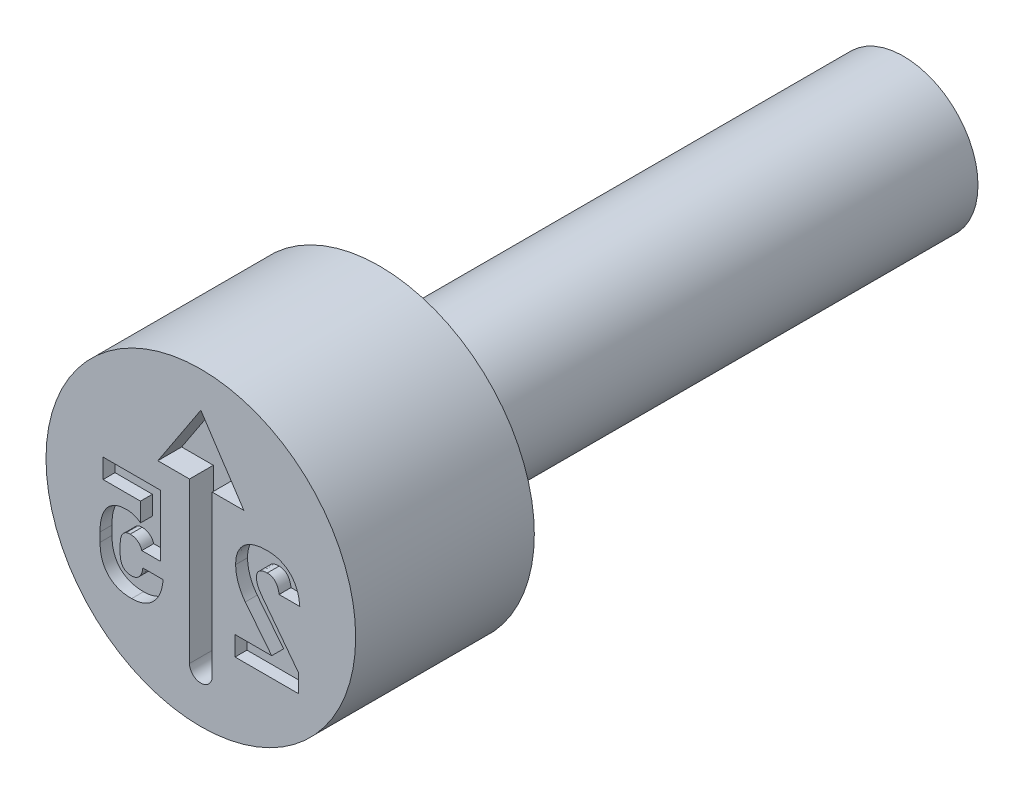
ISO-10303-21;
HEADER;
FILE_DESCRIPTION(('STEP AP214'),'2;1');
FILE_NAME('part.step','',(''),(''),'','','');
FILE_SCHEMA(('AUTOMOTIVE_DESIGN { 1 0 10303 214 1 1 1 1 }'));
ENDSEC;
DATA;
#1=APPLICATION_CONTEXT('core data for automotive mechanical design processes');
#2=APPLICATION_PROTOCOL_DEFINITION('international standard','automotive_design',2000,#1);
#3=PRODUCT_CONTEXT('',#1,'mechanical');
#4=PRODUCT('Part','Part','',(#3));
#5=PRODUCT_RELATED_PRODUCT_CATEGORY('part','',(#4));
#6=PRODUCT_DEFINITION_FORMATION('','',#4);
#7=PRODUCT_DEFINITION_CONTEXT('part definition',#1,'design');
#8=PRODUCT_DEFINITION('design','',#6,#7);
#9=PRODUCT_DEFINITION_SHAPE('','',#8);
#10=(LENGTH_UNIT() NAMED_UNIT(*) SI_UNIT(.MILLI.,.METRE.));
#11=(NAMED_UNIT(*) PLANE_ANGLE_UNIT() SI_UNIT($,.RADIAN.));
#12=(NAMED_UNIT(*) SI_UNIT($,.STERADIAN.) SOLID_ANGLE_UNIT());
#13=UNCERTAINTY_MEASURE_WITH_UNIT(LENGTH_MEASURE(1.E-05),#10,'distance_accuracy_value','');
#14=(GEOMETRIC_REPRESENTATION_CONTEXT(3) GLOBAL_UNCERTAINTY_ASSIGNED_CONTEXT((#13)) GLOBAL_UNIT_ASSIGNED_CONTEXT((#10,
#11,#12)) REPRESENTATION_CONTEXT('',''));
#15=CARTESIAN_POINT('',(0.,0.,0.));
#16=DIRECTION('',(0.,0.,1.));
#17=DIRECTION('',(1.,0.,0.));
#18=AXIS2_PLACEMENT_3D('',#15,#16,#17);
#19=CARTESIAN_POINT('',(0.,1.25,-3.));
#20=DIRECTION('',(0.,0.,1.));
#21=DIRECTION('',(1.,0.,0.));
#22=AXIS2_PLACEMENT_3D('',#19,#20,#21);
#23=PLANE('',#22);
#24=CARTESIAN_POINT('',(0.,0.,-3.));
#25=DIRECTION('',(0.,0.,1.));
#26=DIRECTION('',(1.,0.,0.));
#27=AXIS2_PLACEMENT_3D('',#24,#25,#26);
#28=CIRCLE('',#27,2.6);
#29=CARTESIAN_POINT('',(2.6,0.,-3.));
#30=VERTEX_POINT('',#29);
#31=EDGE_CURVE('E11',#30,#30,#28,.T.);
#32=ORIENTED_EDGE('',*,*,#31,.F.);
#33=EDGE_LOOP('',(#32));
#34=FACE_BOUND('',#33,.T.);
#35=CARTESIAN_POINT('',(0.,0.,-3.));
#36=DIRECTION('',(0.,0.,1.));
#37=DIRECTION('',(1.,0.,0.));
#38=AXIS2_PLACEMENT_3D('',#35,#36,#37);
#39=CIRCLE('',#38,1.25);
#40=CARTESIAN_POINT('',(1.25,0.,-3.));
#41=VERTEX_POINT('',#40);
#42=EDGE_CURVE('E562',#41,#41,#39,.T.);
#43=ORIENTED_EDGE('',*,*,#42,.T.);
#44=EDGE_LOOP('',(#43));
#45=FACE_BOUND('',#44,.T.);
#46=ADVANCED_FACE('F34',(#34,#45),#23,.F.);
#47=CARTESIAN_POINT('',(0.,0.,-0.403888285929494));
#48=DIRECTION('',(0.,0.,1.));
#49=DIRECTION('',(1.,0.,0.));
#50=AXIS2_PLACEMENT_3D('',#47,#48,#49);
#51=CYLINDRICAL_SURFACE('',#50,2.6);
#52=CARTESIAN_POINT('',(0.,0.,0.));
#53=DIRECTION('',(0.,0.,1.));
#54=DIRECTION('',(1.,0.,0.));
#55=AXIS2_PLACEMENT_3D('',#52,#53,#54);
#56=CIRCLE('',#55,2.6);
#57=CARTESIAN_POINT('',(2.6,0.,0.));
#58=VERTEX_POINT('',#57);
#59=EDGE_CURVE('E41',#58,#58,#56,.T.);
#60=ORIENTED_EDGE('',*,*,#59,.F.);
#61=EDGE_LOOP('',(#60));
#62=FACE_BOUND('',#61,.T.);
#63=ORIENTED_EDGE('',*,*,#31,.T.);
#64=EDGE_LOOP('',(#63));
#65=FACE_BOUND('',#64,.T.);
#66=ADVANCED_FACE('F584',(#62,#65),#51,.T.);
#67=CARTESIAN_POINT('',(0.,2.6,0.));
#68=DIRECTION('',(0.,0.,-1.));
#69=DIRECTION('',(-1.,0.,0.));
#70=AXIS2_PLACEMENT_3D('',#67,#68,#69);
#71=PLANE('',#70);
#72=CARTESIAN_POINT('',(-1.16224675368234,-1.31870796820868,0.));
#73=CARTESIAN_POINT('',(-1.13858937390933,-1.31798621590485,0.));
#74=CARTESIAN_POINT('',(-1.09229594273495,-1.31657387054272,0.));
#75=CARTESIAN_POINT('',(-1.02481657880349,-1.30389490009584,0.));
#76=CARTESIAN_POINT('',(-0.96084394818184,-1.28425921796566,0.));
#77=CARTESIAN_POINT('',(-0.90085375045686,-1.2562475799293,0.));
#78=CARTESIAN_POINT('',(-0.845497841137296,-1.22065962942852,0.));
#79=CARTESIAN_POINT('',(-0.796000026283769,-1.17714169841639,0.));
#80=CARTESIAN_POINT('',(-0.751906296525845,-1.12683316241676,0.));
#81=CARTESIAN_POINT('',(-0.71410084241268,-1.06929363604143,0.));
#82=CARTESIAN_POINT('',(-0.682966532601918,-1.00513867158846,0.));
#83=CARTESIAN_POINT('',(-0.65872792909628,-0.935124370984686,0.));
#84=CARTESIAN_POINT('',(-0.642079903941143,-0.85937658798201,0.));
#85=CARTESIAN_POINT('',(-0.637240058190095,-0.80682411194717,0.));
#86=CARTESIAN_POINT('',(-0.634755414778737,-0.779845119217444,0.));
#87=B_SPLINE_CURVE_WITH_KNOTS('',3,(#72,#73,#74,#75,#76,#77,#78,#79,#80,#81,#82,#83,#84,#85,
#86),.UNSPECIFIED.,.F.,.F.,(4,1,1,1,1,1,1,1,1,1,1,1,4),(0.,0.0844304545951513,0.165215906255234,
0.244369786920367,0.322918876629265,0.400936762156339,0.47863123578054,0.557558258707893,
0.639203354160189,0.723781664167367,0.811629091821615,0.903295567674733,1.),.UNSPECIFIED.);
#88=CARTESIAN_POINT('',(-1.16224675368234,-1.31870796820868,0.));
#89=VERTEX_POINT('',#88);
#90=CARTESIAN_POINT('',(-0.634755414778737,-0.779845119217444,0.));
#91=VERTEX_POINT('',#90);
#92=EDGE_CURVE('E856',#89,#91,#87,.T.);
#93=ORIENTED_EDGE('',*,*,#92,.F.);
#94=CARTESIAN_POINT('',(-1.69303949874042,-0.766272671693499,0.));
#95=CARTESIAN_POINT('',(-1.69223594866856,-0.794307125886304,0.));
#96=CARTESIAN_POINT('',(-1.69068145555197,-0.84854066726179,0.));
#97=CARTESIAN_POINT('',(-1.67956520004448,-0.926966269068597,0.));
#98=CARTESIAN_POINT('',(-1.65952573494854,-0.998905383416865,0.));
#99=CARTESIAN_POINT('',(-1.63267580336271,-1.06482310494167,0.));
#100=CARTESIAN_POINT('',(-1.59761539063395,-1.12340953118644,0.));
#101=CARTESIAN_POINT('',(-1.55563262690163,-1.17515956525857,0.));
#102=CARTESIAN_POINT('',(-1.50596136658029,-1.21887835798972,0.));
#103=CARTESIAN_POINT('',(-1.44977388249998,-1.25567141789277,0.));
#104=CARTESIAN_POINT('',(-1.38653555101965,-1.2838891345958,0.));
#105=CARTESIAN_POINT('',(-1.31725692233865,-1.30438838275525,0.));
#106=CARTESIAN_POINT('',(-1.24166383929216,-1.31658143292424,0.));
#107=CARTESIAN_POINT('',(-1.18931534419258,-1.31798315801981,0.));
#108=CARTESIAN_POINT('',(-1.16224675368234,-1.31870796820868,0.));
#109=B_SPLINE_CURVE_WITH_KNOTS('',3,(#94,#95,#96,#97,#98,#99,#100,#101,#102,#103,#104,#105,#106,
#107,#108),.UNSPECIFIED.,.F.,.F.,(4,1,1,1,1,1,1,1,1,1,1,1,4),(0.,0.0965919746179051,
0.1868602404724,0.272108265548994,0.353324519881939,0.431359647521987,0.506505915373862,
0.582010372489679,0.6584354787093,0.737063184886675,0.819709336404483,0.906774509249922,1.),.UNSPECIFIED.);
#110=CARTESIAN_POINT('',(-1.69303949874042,-0.766272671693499,0.));
#111=VERTEX_POINT('',#110);
#112=EDGE_CURVE('E48',#111,#89,#109,.T.);
#113=ORIENTED_EDGE('',*,*,#112,.F.);
#114=DIRECTION('',(0.,-1.,0.));
#115=VECTOR('',#114,1.);
#116=CARTESIAN_POINT('',(-1.69303949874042,-0.61550845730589,0.));
#117=LINE('',#116,#115);
#118=CARTESIAN_POINT('',(-1.69303949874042,-0.61550845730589,0.));
#119=VERTEX_POINT('',#118);
#120=EDGE_CURVE('E329',#119,#111,#117,.T.);
#121=ORIENTED_EDGE('',*,*,#120,.F.);
#122=CARTESIAN_POINT('',(-1.24991742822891,-0.0645404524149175,0.));
#123=CARTESIAN_POINT('',(-1.27247651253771,-0.0652546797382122,0.));
#124=CARTESIAN_POINT('',(-1.316229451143,-0.0666399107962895,0.));
#125=CARTESIAN_POINT('',(-1.37933950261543,-0.0791003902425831,0.));
#126=CARTESIAN_POINT('',(-1.43750127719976,-0.099063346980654,0.));
#127=CARTESIAN_POINT('',(-1.49023484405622,-0.12782418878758,0.));
#128=CARTESIAN_POINT('',(-1.53759985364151,-0.163871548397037,0.));
#129=CARTESIAN_POINT('',(-1.57873993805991,-0.207918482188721,0.));
#130=CARTESIAN_POINT('',(-1.61391155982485,-0.259247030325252,0.));
#131=CARTESIAN_POINT('',(-1.64269651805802,-0.317891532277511,0.));
#132=CARTESIAN_POINT('',(-1.66535149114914,-0.383338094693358,0.));
#133=CARTESIAN_POINT('',(-1.68180647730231,-0.455129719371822,0.));
#134=CARTESIAN_POINT('',(-1.69118379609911,-0.533336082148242,0.));
#135=CARTESIAN_POINT('',(-1.69240658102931,-0.587482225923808,0.));
#136=CARTESIAN_POINT('',(-1.69303949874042,-0.61550845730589,0.));
#137=B_SPLINE_CURVE_WITH_KNOTS('',3,(#122,#123,#124,#125,#126,#127,#128,#129,#130,#131,#132,
#133,#134,#135,#136),.UNSPECIFIED.,.F.,.F.,(4,1,1,1,1,1,1,1,1,1,1,1,4),(0.,0.0843949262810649,
0.163682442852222,0.239848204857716,0.313806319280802,0.3876154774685,0.461788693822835,
0.538496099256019,0.61978489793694,0.70565234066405,0.797279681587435,0.895071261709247,1.),.UNSPECIFIED.);
#138=CARTESIAN_POINT('',(-1.24991742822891,-0.0645404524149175,0.));
#139=VERTEX_POINT('',#138);
#140=EDGE_CURVE('E332',#139,#119,#137,.T.);
#141=ORIENTED_EDGE('',*,*,#140,.F.);
#142=CARTESIAN_POINT('',(-1.01368347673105,-0.144874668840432,0.));
#143=CARTESIAN_POINT('',(-1.02051269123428,-0.13882757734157,0.));
#144=CARTESIAN_POINT('',(-1.0345609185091,-0.12638823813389,0.));
#145=CARTESIAN_POINT('',(-1.05912126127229,-0.11059374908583,0.));
#146=CARTESIAN_POINT('',(-1.08721075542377,-0.0971789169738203,0.));
#147=CARTESIAN_POINT('',(-1.12865941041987,-0.0817286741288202,0.));
#148=CARTESIAN_POINT('',(-1.18318332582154,-0.0679896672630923,0.));
#149=CARTESIAN_POINT('',(-1.22794364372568,-0.0656761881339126,0.));
#150=CARTESIAN_POINT('',(-1.24991742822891,-0.0645404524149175,0.));
#151=B_SPLINE_CURVE_WITH_KNOTS('',3,(#142,#143,#144,#145,#146,#147,#148,#149,#150),
.UNSPECIFIED.,.F.,.F.,(4,1,1,1,1,1,4),(0.,0.107291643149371,0.220707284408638,0.342410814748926,
0.47317918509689,0.741372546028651,1.),.UNSPECIFIED.);
#152=CARTESIAN_POINT('',(-1.01368347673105,-0.144874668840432,0.));
#153=VERTEX_POINT('',#152);
#154=EDGE_CURVE('E783',#153,#139,#151,.T.);
#155=ORIENTED_EDGE('',*,*,#154,.F.);
#156=DIRECTION('',(0.,-1.,0.));
#157=VECTOR('',#156,1.);
#158=CARTESIAN_POINT('',(-1.01368347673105,0.173160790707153,0.));
#159=LINE('',#158,#157);
#160=CARTESIAN_POINT('',(-1.01368347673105,0.173160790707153,0.));
#161=VERTEX_POINT('',#160);
#162=EDGE_CURVE('E791',#161,#153,#159,.T.);
#163=ORIENTED_EDGE('',*,*,#162,.F.);
#164=DIRECTION('',(1.,0.,0.));
#165=VECTOR('',#164,1.);
#166=CARTESIAN_POINT('',(-1.64131746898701,0.173160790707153,0.));
#167=LINE('',#166,#165);
#168=CARTESIAN_POINT('',(-1.64131746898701,0.173160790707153,0.));
#169=VERTEX_POINT('',#168);
#170=EDGE_CURVE('E797',#169,#161,#167,.T.);
#171=ORIENTED_EDGE('',*,*,#170,.F.);
#172=DIRECTION('',(0.,-1.,0.));
#173=VECTOR('',#172,1.);
#174=CARTESIAN_POINT('',(-1.64131746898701,0.5,0.));
#175=LINE('',#174,#173);
#176=CARTESIAN_POINT('',(-1.64131746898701,0.5,0.));
#177=VERTEX_POINT('',#176);
#178=EDGE_CURVE('E800',#177,#169,#175,.T.);
#179=ORIENTED_EDGE('',*,*,#178,.F.);
#180=DIRECTION('',(-1.,0.,0.));
#181=VECTOR('',#180,1.);
#182=CARTESIAN_POINT('',(-0.674372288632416,0.5,0.));
#183=LINE('',#182,#181);
#184=CARTESIAN_POINT('',(-0.674372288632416,0.5,0.));
#185=VERTEX_POINT('',#184);
#186=EDGE_CURVE('E803',#185,#177,#183,.T.);
#187=ORIENTED_EDGE('',*,*,#186,.F.);
#188=DIRECTION('',(0.,1.,0.));
#189=VECTOR('',#188,1.);
#190=CARTESIAN_POINT('',(-0.674372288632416,-0.534807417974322,0.));
#191=LINE('',#190,#189);
#192=CARTESIAN_POINT('',(-0.674372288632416,-0.534807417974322,0.));
#193=VERTEX_POINT('',#192);
#194=EDGE_CURVE('E806',#193,#185,#191,.T.);
#195=ORIENTED_EDGE('',*,*,#194,.F.);
#196=DIRECTION('',(1.,0.,0.));
#197=VECTOR('',#196,1.);
#198=CARTESIAN_POINT('',(-0.991307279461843,-0.534807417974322,0.));
#199=LINE('',#198,#197);
#200=CARTESIAN_POINT('',(-0.991307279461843,-0.534807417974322,0.));
#201=VERTEX_POINT('',#200);
#202=EDGE_CURVE('E809',#201,#193,#199,.T.);
#203=ORIENTED_EDGE('',*,*,#202,.F.);
#204=CARTESIAN_POINT('',(-1.18682388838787,-0.39358059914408,0.));
#205=CARTESIAN_POINT('',(-1.17504707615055,-0.393939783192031,0.));
#206=CARTESIAN_POINT('',(-1.15224760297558,-0.394635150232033,0.));
#207=CARTESIAN_POINT('',(-1.11941993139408,-0.401835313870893,0.));
#208=CARTESIAN_POINT('',(-1.08924806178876,-0.413615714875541,0.));
#209=CARTESIAN_POINT('',(-1.06207450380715,-0.430271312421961,0.));
#210=CARTESIAN_POINT('',(-1.0380743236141,-0.450684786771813,0.));
#211=CARTESIAN_POINT('',(-1.01831464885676,-0.475350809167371,0.));
#212=CARTESIAN_POINT('',(-1.00175039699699,-0.503222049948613,0.));
#213=CARTESIAN_POINT('',(-0.994838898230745,-0.524125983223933,0.));
#214=CARTESIAN_POINT('',(-0.991307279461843,-0.534807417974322,0.));
#215=B_SPLINE_CURVE_WITH_KNOTS('',3,(#204,#205,#206,#207,#208,#209,#210,#211,#212,#213,#214),
.UNSPECIFIED.,.F.,.F.,(4,1,1,1,1,1,1,1,4),(0.,0.135635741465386,0.262585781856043,
0.385395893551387,0.507524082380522,0.628507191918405,0.746772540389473,0.870606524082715,1.),.UNSPECIFIED.);
#216=CARTESIAN_POINT('',(-1.18682388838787,-0.39358059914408,0.));
#217=VERTEX_POINT('',#216);
#218=EDGE_CURVE('E812',#217,#201,#215,.T.);
#219=ORIENTED_EDGE('',*,*,#218,.F.);
#220=CARTESIAN_POINT('',(-1.35409513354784,-0.61550845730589,0.));
#221=CARTESIAN_POINT('',(-1.35373285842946,-0.598712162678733,0.));
#222=CARTESIAN_POINT('',(-1.35304531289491,-0.566835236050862,0.));
#223=CARTESIAN_POINT('',(-1.3444922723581,-0.522244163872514,0.));
#224=CARTESIAN_POINT('',(-1.33119398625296,-0.483339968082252,0.));
#225=CARTESIAN_POINT('',(-1.31155427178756,-0.451044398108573,0.));
#226=CARTESIAN_POINT('',(-1.28714008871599,-0.424976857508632,0.));
#227=CARTESIAN_POINT('',(-1.25759591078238,-0.406462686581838,0.));
#228=CARTESIAN_POINT('',(-1.22351514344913,-0.395527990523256,0.));
#229=CARTESIAN_POINT('',(-1.1993781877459,-0.394246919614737,0.));
#230=CARTESIAN_POINT('',(-1.18682388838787,-0.39358059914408,0.));
#231=B_SPLINE_CURVE_WITH_KNOTS('',3,(#220,#221,#222,#223,#224,#225,#226,#227,#228,#229,#230),
.UNSPECIFIED.,.F.,.F.,(4,1,1,1,1,1,1,1,4),(0.,0.160198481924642,0.304033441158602,
0.431843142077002,0.550810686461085,0.662316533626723,0.769888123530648,0.880312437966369,1.),.UNSPECIFIED.);
#232=CARTESIAN_POINT('',(-1.35409513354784,-0.61550845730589,0.));
#233=VERTEX_POINT('',#232);
#234=EDGE_CURVE('E817',#233,#217,#231,.T.);
#235=ORIENTED_EDGE('',*,*,#234,.F.);
#236=DIRECTION('',(0.,1.,0.));
#237=VECTOR('',#236,1.);
#238=CARTESIAN_POINT('',(-1.35409513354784,-0.766272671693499,0.));
#239=LINE('',#238,#237);
#240=CARTESIAN_POINT('',(-1.35409513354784,-0.766272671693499,0.));
#241=VERTEX_POINT('',#240);
#242=EDGE_CURVE('E825',#241,#233,#239,.T.);
#243=ORIENTED_EDGE('',*,*,#242,.F.);
#244=CARTESIAN_POINT('',(-1.16701545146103,-0.989300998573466,0.));
#245=CARTESIAN_POINT('',(-1.18116283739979,-0.988684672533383,0.));
#246=CARTESIAN_POINT('',(-1.20822311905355,-0.987505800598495,0.));
#247=CARTESIAN_POINT('',(-1.24615258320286,-0.976127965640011,0.));
#248=CARTESIAN_POINT('',(-1.27917161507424,-0.957911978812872,0.));
#249=CARTESIAN_POINT('',(-1.30644538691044,-0.931700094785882,0.));
#250=CARTESIAN_POINT('',(-1.32820290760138,-0.899040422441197,0.));
#251=CARTESIAN_POINT('',(-1.34360412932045,-0.859930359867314,0.));
#252=CARTESIAN_POINT('',(-1.35272522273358,-0.814990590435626,0.));
#253=CARTESIAN_POINT('',(-1.35362280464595,-0.783070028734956,0.));
#254=CARTESIAN_POINT('',(-1.35409513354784,-0.766272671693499,0.));
#255=B_SPLINE_CURVE_WITH_KNOTS('',3,(#244,#245,#246,#247,#248,#249,#250,#251,#252,#253,#254),
.UNSPECIFIED.,.F.,.F.,(4,1,1,1,1,1,1,1,4),(0.,0.128261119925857,0.245330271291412,
0.356275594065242,0.467886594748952,0.585607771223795,0.710231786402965,0.847517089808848,1.),.UNSPECIFIED.);
#256=CARTESIAN_POINT('',(-1.16701545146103,-0.989300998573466,0.));
#257=VERTEX_POINT('',#256);
#258=EDGE_CURVE('E831',#257,#241,#255,.T.);
#259=ORIENTED_EDGE('',*,*,#258,.F.);
#260=CARTESIAN_POINT('',(-0.974066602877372,-0.779845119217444,0.));
#261=CARTESIAN_POINT('',(-0.976003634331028,-0.795599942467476,0.));
#262=CARTESIAN_POINT('',(-0.979695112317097,-0.825624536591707,0.));
#263=CARTESIAN_POINT('',(-0.993006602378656,-0.867290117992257,0.));
#264=CARTESIAN_POINT('',(-1.01038561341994,-0.903913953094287,0.));
#265=CARTESIAN_POINT('',(-1.03334192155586,-0.934644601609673,0.));
#266=CARTESIAN_POINT('',(-1.0606026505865,-0.959593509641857,0.));
#267=CARTESIAN_POINT('',(-1.09290570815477,-0.976514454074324,0.));
#268=CARTESIAN_POINT('',(-1.12860713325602,-0.987805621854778,0.));
#269=CARTESIAN_POINT('',(-1.15396333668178,-0.988792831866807,0.));
#270=CARTESIAN_POINT('',(-1.16701545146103,-0.989300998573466,0.));
#271=B_SPLINE_CURVE_WITH_KNOTS('',3,(#260,#261,#262,#263,#264,#265,#266,#267,#268,#269,#270),
.UNSPECIFIED.,.F.,.F.,(4,1,1,1,1,1,1,1,4),(0.,0.150277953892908,0.286390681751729,
0.412971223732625,0.533144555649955,0.648163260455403,0.760273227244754,0.876600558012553,1.),.UNSPECIFIED.);
#272=CARTESIAN_POINT('',(-0.974066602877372,-0.779845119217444,0.));
#273=VERTEX_POINT('',#272);
#274=EDGE_CURVE('E836',#273,#257,#271,.T.);
#275=ORIENTED_EDGE('',*,*,#274,.F.);
#276=DIRECTION('',(0.,-1.,0.));
#277=VECTOR('',#276,1.);
#278=CARTESIAN_POINT('',(-0.974066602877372,-0.778744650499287,0.));
#279=LINE('',#278,#277);
#280=CARTESIAN_POINT('',(-0.974066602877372,-0.778744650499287,0.));
#281=VERTEX_POINT('',#280);
#282=EDGE_CURVE('E844',#281,#273,#279,.T.);
#283=ORIENTED_EDGE('',*,*,#282,.F.);
#284=DIRECTION('',(-1.,0.,0.));
#285=VECTOR('',#284,1.);
#286=CARTESIAN_POINT('',(-0.634755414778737,-0.778744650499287,0.));
#287=LINE('',#286,#285);
#288=CARTESIAN_POINT('',(-0.634755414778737,-0.778744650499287,0.));
#289=VERTEX_POINT('',#288);
#290=EDGE_CURVE('E850',#289,#281,#287,.T.);
#291=ORIENTED_EDGE('',*,*,#290,.F.);
#292=DIRECTION('',(0.,1.,0.));
#293=VECTOR('',#292,1.);
#294=CARTESIAN_POINT('',(-0.634755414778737,-0.779845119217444,0.));
#295=LINE('',#294,#293);
#296=EDGE_CURVE('E853',#91,#289,#295,.T.);
#297=ORIENTED_EDGE('',*,*,#296,.F.);
#298=EDGE_LOOP('',(#93,#113,#121,#141,#155,#163,#171,#179,#187,#195,#203,#219,#235,#243,#259,
#275,#283,#291,#297));
#299=FACE_BOUND('',#298,.T.);
#300=DIRECTION('',(-0.60539313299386,0.795926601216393,0.));
#301=VECTOR('',#300,1.);
#302=CARTESIAN_POINT('',(1.63910641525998,-0.99406969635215,0.));
#303=LINE('',#302,#301);
#304=CARTESIAN_POINT('',(1.63910641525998,-0.99406969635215,0.));
#305=VERTEX_POINT('',#304);
#306=CARTESIAN_POINT('',(1.02137664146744,-0.181923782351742,0.));
#307=VERTEX_POINT('',#306);
#308=EDGE_CURVE('E405',#305,#307,#303,.T.);
#309=ORIENTED_EDGE('',*,*,#308,.F.);
#310=DIRECTION('',(0.,1.,0.));
#311=VECTOR('',#310,1.);
#312=CARTESIAN_POINT('',(1.63910641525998,-1.3,0.));
#313=LINE('',#312,#311);
#314=CARTESIAN_POINT('',(1.63910641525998,-1.3,0.));
#315=VERTEX_POINT('',#314);
#316=EDGE_CURVE('E56',#315,#305,#313,.T.);
#317=ORIENTED_EDGE('',*,*,#316,.F.);
#318=DIRECTION('',(1.,0.,0.));
#319=VECTOR('',#318,1.);
#320=CARTESIAN_POINT('',(0.574586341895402,-1.3,0.));
#321=LINE('',#320,#319);
#322=CARTESIAN_POINT('',(0.574586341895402,-1.3,0.));
#323=VERTEX_POINT('',#322);
#324=EDGE_CURVE('E481',#323,#315,#321,.T.);
#325=ORIENTED_EDGE('',*,*,#324,.F.);
#326=DIRECTION('',(0.,-1.,0.));
#327=VECTOR('',#326,1.);
#328=CARTESIAN_POINT('',(0.574586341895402,-0.973160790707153,0.));
#329=LINE('',#328,#327);
#330=CARTESIAN_POINT('',(0.574586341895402,-0.973160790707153,0.));
#331=VERTEX_POINT('',#330);
#332=EDGE_CURVE('E478',#331,#323,#329,.T.);
#333=ORIENTED_EDGE('',*,*,#332,.F.);
#334=DIRECTION('',(-1.,0.,0.));
#335=VECTOR('',#334,1.);
#336=CARTESIAN_POINT('',(1.18974835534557,-0.973160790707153,0.));
#337=LINE('',#336,#335);
#338=CARTESIAN_POINT('',(1.18974835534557,-0.973160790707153,0.));
#339=VERTEX_POINT('',#338);
#340=EDGE_CURVE('E475',#339,#331,#337,.T.);
#341=ORIENTED_EDGE('',*,*,#340,.F.);
#342=DIRECTION('',(0.620676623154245,-0.78406666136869,0.));
#343=VECTOR('',#342,1.);
#344=CARTESIAN_POINT('',(0.746626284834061,-0.413389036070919,0.));
#345=LINE('',#344,#343);
#346=CARTESIAN_POINT('',(0.746626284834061,-0.413389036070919,0.));
#347=VERTEX_POINT('',#346);
#348=EDGE_CURVE('E469',#347,#339,#345,.T.);
#349=ORIENTED_EDGE('',*,*,#348,.F.);
#350=CARTESIAN_POINT('',(0.584490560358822,0.0480741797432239,0.));
#351=CARTESIAN_POINT('',(0.584960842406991,0.0276285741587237,0.));
#352=CARTESIAN_POINT('',(0.585902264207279,-0.0132999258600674,0.));
#353=CARTESIAN_POINT('',(0.594298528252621,-0.0744458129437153,0.));
#354=CARTESIAN_POINT('',(0.608027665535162,-0.135238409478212,0.));
#355=CARTESIAN_POINT('',(0.626656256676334,-0.195464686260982,0.));
#356=CARTESIAN_POINT('',(0.649918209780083,-0.254118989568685,0.));
#357=CARTESIAN_POINT('',(0.677679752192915,-0.310266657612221,0.));
#358=CARTESIAN_POINT('',(0.70937505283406,-0.363764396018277,0.));
#359=CARTESIAN_POINT('',(0.73421094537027,-0.396849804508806,0.));
#360=CARTESIAN_POINT('',(0.746626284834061,-0.413389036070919,0.));
#361=B_SPLINE_CURVE_WITH_KNOTS('',3,(#350,#351,#352,#353,#354,#355,#356,#357,#358,#359,#360),
.UNSPECIFIED.,.F.,.F.,(4,1,1,1,1,1,1,1,4),(0.,0.123148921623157,0.24652244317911,
0.371108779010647,0.498350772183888,0.625999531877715,0.750879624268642,0.875465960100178,1.),.UNSPECIFIED.);
#362=CARTESIAN_POINT('',(0.584490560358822,0.0480741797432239,0.));
#363=VERTEX_POINT('',#362);
#364=EDGE_CURVE('E464',#363,#347,#361,.T.);
#365=ORIENTED_EDGE('',*,*,#364,.F.);
#366=DIRECTION('',(0.,-1.,0.));
#367=VECTOR('',#366,1.);
#368=CARTESIAN_POINT('',(0.584490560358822,0.0495414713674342,0.));
#369=LINE('',#368,#367);
#370=CARTESIAN_POINT('',(0.584490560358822,0.0495414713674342,0.));
#371=VERTEX_POINT('',#370);
#372=EDGE_CURVE('E458',#371,#363,#369,.T.);
#373=ORIENTED_EDGE('',*,*,#372,.F.);
#374=CARTESIAN_POINT('',(1.11675059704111,0.518707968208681,0.));
#375=CARTESIAN_POINT('',(1.08969430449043,0.518142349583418,0.));
#376=CARTESIAN_POINT('',(1.03732850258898,0.517047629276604,0.));
#377=CARTESIAN_POINT('',(0.961925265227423,0.50674208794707,0.));
#378=CARTESIAN_POINT('',(0.892590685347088,0.489592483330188,0.));
#379=CARTESIAN_POINT('',(0.829498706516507,0.465497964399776,0.));
#380=CARTESIAN_POINT('',(0.773063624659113,0.43452504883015,0.));
#381=CARTESIAN_POINT('',(0.723024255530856,0.397760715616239,0.));
#382=CARTESIAN_POINT('',(0.680793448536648,0.353777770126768,0.));
#383=CARTESIAN_POINT('',(0.645665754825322,0.303812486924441,0.));
#384=CARTESIAN_POINT('',(0.617974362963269,0.248057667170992,0.));
#385=CARTESIAN_POINT('',(0.598582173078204,0.186561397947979,0.));
#386=CARTESIAN_POINT('',(0.586706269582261,0.119817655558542,0.));
#387=CARTESIAN_POINT('',(0.585243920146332,0.0734359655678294,0.));
#388=CARTESIAN_POINT('',(0.584490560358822,0.0495414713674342,0.));
#389=B_SPLINE_CURVE_WITH_KNOTS('',3,(#374,#375,#376,#377,#378,#379,#380,#381,#382,#383,#384,
#385,#386,#387,#388),.UNSPECIFIED.,.F.,.F.,(4,1,1,1,1,1,1,1,1,1,1,1,4),(0.,0.100715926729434,
0.194929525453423,0.2827284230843,0.366191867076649,0.44566981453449,0.521804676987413,
0.596515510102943,0.671682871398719,0.748455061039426,0.827368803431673,0.911065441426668,1.),.UNSPECIFIED.);
#390=CARTESIAN_POINT('',(1.11675059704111,0.518707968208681,0.));
#391=VERTEX_POINT('',#390);
#392=EDGE_CURVE('E450',#391,#371,#389,.T.);
#393=ORIENTED_EDGE('',*,*,#392,.F.);
#394=CARTESIAN_POINT('',(1.66148261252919,-0.019788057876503,0.));
#395=CARTESIAN_POINT('',(1.65899095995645,0.00731059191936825,0.));
#396=CARTESIAN_POINT('',(1.65413706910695,0.0601004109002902,0.));
#397=CARTESIAN_POINT('',(1.63763246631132,0.136016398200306,0.));
#398=CARTESIAN_POINT('',(1.61325038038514,0.205870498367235,0.));
#399=CARTESIAN_POINT('',(1.5820988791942,0.269855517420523,0.));
#400=CARTESIAN_POINT('',(1.54390170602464,0.327163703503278,0.));
#401=CARTESIAN_POINT('',(1.49958162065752,0.377779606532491,0.));
#402=CARTESIAN_POINT('',(1.4486477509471,0.420720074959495,0.));
#403=CARTESIAN_POINT('',(1.39198234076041,0.456401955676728,0.));
#404=CARTESIAN_POINT('',(1.32983289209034,0.48432664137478,0.));
#405=CARTESIAN_POINT('',(1.2629594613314,0.504672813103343,0.));
#406=CARTESIAN_POINT('',(1.19126133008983,0.516402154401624,0.));
#407=CARTESIAN_POINT('',(1.14198182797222,0.517927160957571,0.));
#408=CARTESIAN_POINT('',(1.11675059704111,0.518707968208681,0.));
#409=B_SPLINE_CURVE_WITH_KNOTS('',3,(#394,#395,#396,#397,#398,#399,#400,#401,#402,#403,#404,
#405,#406,#407,#408),.UNSPECIFIED.,.F.,.F.,(4,1,1,1,1,1,1,1,1,1,1,1,4),(0.,0.0953291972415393,
0.185707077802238,0.271513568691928,0.35413169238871,0.434493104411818,0.512233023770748,
0.58917600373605,0.667186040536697,0.746219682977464,0.827302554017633,0.911578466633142,1.),.UNSPECIFIED.);
#410=CARTESIAN_POINT('',(1.66148261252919,-0.019788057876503,0.));
#411=VERTEX_POINT('',#410);
#412=EDGE_CURVE('E445',#411,#391,#409,.T.);
#413=ORIENTED_EDGE('',*,*,#412,.F.);
#414=DIRECTION('',(0.,1.,0.));
#415=VECTOR('',#414,1.);
#416=CARTESIAN_POINT('',(1.66148261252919,-0.0212553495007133,0.));
#417=LINE('',#416,#415);
#418=CARTESIAN_POINT('',(1.66148261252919,-0.0212553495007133,0.));
#419=VERTEX_POINT('',#418);
#420=EDGE_CURVE('E442',#419,#411,#417,.T.);
#421=ORIENTED_EDGE('',*,*,#420,.F.);
#422=DIRECTION('',(1.,0.,0.));
#423=VECTOR('',#422,1.);
#424=CARTESIAN_POINT('',(1.31373449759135,-0.0212553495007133,0.));
#425=LINE('',#424,#423);
#426=CARTESIAN_POINT('',(1.31373449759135,-0.0212553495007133,0.));
#427=VERTEX_POINT('',#426);
#428=EDGE_CURVE('E439',#427,#419,#425,.T.);
#429=ORIENTED_EDGE('',*,*,#428,.F.);
#430=DIRECTION('',(0.,-1.,0.));
#431=VECTOR('',#430,1.);
#432=CARTESIAN_POINT('',(1.31373449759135,-0.019788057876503,0.));
#433=LINE('',#432,#431);
#434=CARTESIAN_POINT('',(1.31373449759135,-0.019788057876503,0.));
#435=VERTEX_POINT('',#434);
#436=EDGE_CURVE('E433',#435,#427,#433,.T.);
#437=ORIENTED_EDGE('',*,*,#436,.F.);
#438=CARTESIAN_POINT('',(1.11418283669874,0.191868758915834,0.));
#439=CARTESIAN_POINT('',(1.12757880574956,0.191302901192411,0.));
#440=CARTESIAN_POINT('',(1.15357614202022,0.190204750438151,0.));
#441=CARTESIAN_POINT('',(1.19055754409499,0.179740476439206,0.));
#442=CARTESIAN_POINT('',(1.223409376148,0.161975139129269,0.));
#443=CARTESIAN_POINT('',(1.2518479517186,0.137423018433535,0.));
#444=CARTESIAN_POINT('',(1.27571049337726,0.106536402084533,0.));
#445=CARTESIAN_POINT('',(1.29329896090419,0.0693280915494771,0.));
#446=CARTESIAN_POINT('',(1.30746324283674,0.0270392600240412,0.));
#447=CARTESIAN_POINT('',(1.31157369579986,-0.00365339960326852,0.));
#448=CARTESIAN_POINT('',(1.31373449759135,-0.019788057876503,0.));
#449=B_SPLINE_CURVE_WITH_KNOTS('',3,(#438,#439,#440,#441,#442,#443,#444,#445,#446,#447,#448),
.UNSPECIFIED.,.F.,.F.,(4,1,1,1,1,1,1,1,4),(0.,0.124212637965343,0.241057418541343,
0.353359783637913,0.468536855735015,0.587568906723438,0.713021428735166,0.849139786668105,1.),.UNSPECIFIED.);
#450=CARTESIAN_POINT('',(1.11418283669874,0.191868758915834,0.));
#451=VERTEX_POINT('',#450);
#452=EDGE_CURVE('E425',#451,#435,#449,.T.);
#453=ORIENTED_EDGE('',*,*,#452,.F.);
#454=CARTESIAN_POINT('',(0.933705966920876,0.0396372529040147,0.));
#455=CARTESIAN_POINT('',(0.934198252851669,0.0511955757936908,0.));
#456=CARTESIAN_POINT('',(0.935136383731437,0.0732218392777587,0.));
#457=CARTESIAN_POINT('',(0.944193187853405,0.104210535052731,0.));
#458=CARTESIAN_POINT('',(0.959169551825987,0.131007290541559,0.));
#459=CARTESIAN_POINT('',(0.980147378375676,0.153470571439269,0.));
#460=CARTESIAN_POINT('',(1.0068313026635,0.170734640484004,0.));
#461=CARTESIAN_POINT('',(1.03830668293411,0.183345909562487,0.));
#462=CARTESIAN_POINT('',(1.0747407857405,0.190481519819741,0.));
#463=CARTESIAN_POINT('',(1.10057882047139,0.191390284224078,0.));
#464=CARTESIAN_POINT('',(1.11418283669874,0.191868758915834,0.));
#465=B_SPLINE_CURVE_WITH_KNOTS('',3,(#454,#455,#456,#457,#458,#459,#460,#461,#462,#463,#464),
.UNSPECIFIED.,.F.,.F.,(4,1,1,1,1,1,1,1,4),(0.,0.129170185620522,0.246154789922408,
0.35773418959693,0.470108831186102,0.586692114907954,0.710769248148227,0.847716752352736,1.),.UNSPECIFIED.);
#466=CARTESIAN_POINT('',(0.933705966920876,0.0396372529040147,0.));
#467=VERTEX_POINT('',#466);
#468=EDGE_CURVE('E420',#467,#451,#465,.T.);
#469=ORIENTED_EDGE('',*,*,#468,.F.);
#470=DIRECTION('',(0.,1.,0.));
#471=VECTOR('',#470,1.);
#472=CARTESIAN_POINT('',(0.933705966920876,0.0370694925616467,0.));
#473=LINE('',#472,#471);
#474=CARTESIAN_POINT('',(0.933705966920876,0.0370694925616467,0.));
#475=VERTEX_POINT('',#474);
#476=EDGE_CURVE('E414',#475,#467,#473,.T.);
#477=ORIENTED_EDGE('',*,*,#476,.F.);
#478=CARTESIAN_POINT('',(1.02137664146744,-0.181923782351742,0.));
#479=CARTESIAN_POINT('',(1.00842117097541,-0.163949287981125,0.));
#480=CARTESIAN_POINT('',(0.983129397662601,-0.128859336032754,0.));
#481=CARTESIAN_POINT('',(0.960501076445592,-0.0804604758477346,0.));
#482=CARTESIAN_POINT('',(0.946126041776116,-0.0425107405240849,0.));
#483=CARTESIAN_POINT('',(0.939480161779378,-0.0149826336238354,0.));
#484=CARTESIAN_POINT('',(0.934560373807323,0.0113404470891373,0.));
#485=CARTESIAN_POINT('',(0.933986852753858,0.0286110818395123,0.));
#486=CARTESIAN_POINT('',(0.933705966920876,0.0370694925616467,0.));
#487=B_SPLINE_CURVE_WITH_KNOTS('',3,(#478,#479,#480,#481,#482,#483,#484,#485,#486),
.UNSPECIFIED.,.F.,.F.,(4,1,1,1,1,1,4),(0.,0.27673722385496,0.540248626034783,0.66563356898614,
0.784034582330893,0.894229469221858,1.),.UNSPECIFIED.);
#488=EDGE_CURVE('E409',#307,#475,#487,.T.);
#489=ORIENTED_EDGE('',*,*,#488,.F.);
#490=EDGE_LOOP('',(#309,#317,#325,#333,#341,#349,#365,#373,#393,#413,#421,#429,#437,#453,#469,
#477,#489));
#491=FACE_BOUND('',#490,.T.);
#492=DIRECTION('',(0.,1.,0.));
#493=VECTOR('',#492,1.);
#494=CARTESIAN_POINT('',(0.190473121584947,0.906351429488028,0.));
#495=LINE('',#494,#493);
#496=CARTESIAN_POINT('',(0.190473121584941,-1.77616183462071,0.));
#497=VERTEX_POINT('',#496);
#498=CARTESIAN_POINT('',(0.190473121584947,0.906351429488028,0.));
#499=VERTEX_POINT('',#498);
#500=EDGE_CURVE('E543',#497,#499,#495,.T.);
#501=ORIENTED_EDGE('',*,*,#500,.F.);
#502=CARTESIAN_POINT('',(1.6342449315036E-13,-1.77616183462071,0.));
#503=DIRECTION('',(0.,0.,1.));
#504=DIRECTION('',(1.,0.,0.));
#505=AXIS2_PLACEMENT_3D('',#502,#503,#504);
#506=CIRCLE('',#505,0.190473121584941);
#507=CARTESIAN_POINT('',(-0.190473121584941,-1.77616183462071,0.));
#508=VERTEX_POINT('',#507);
#509=EDGE_CURVE('E487',#508,#497,#506,.T.);
#510=ORIENTED_EDGE('',*,*,#509,.F.);
#511=DIRECTION('',(0.,-1.,0.));
#512=VECTOR('',#511,1.);
#513=CARTESIAN_POINT('',(-0.190473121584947,0.906351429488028,0.));
#514=LINE('',#513,#512);
#515=CARTESIAN_POINT('',(-0.190473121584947,0.906351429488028,0.));
#516=VERTEX_POINT('',#515);
#517=EDGE_CURVE('E523',#516,#508,#514,.T.);
#518=ORIENTED_EDGE('',*,*,#517,.F.);
#519=DIRECTION('',(1.,0.,0.));
#520=VECTOR('',#519,1.);
#521=CARTESIAN_POINT('',(-0.721917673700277,0.906351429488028,0.));
#522=LINE('',#521,#520);
#523=CARTESIAN_POINT('',(-0.721917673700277,0.906351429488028,0.));
#524=VERTEX_POINT('',#523);
#525=EDGE_CURVE('E555',#524,#516,#522,.T.);
#526=ORIENTED_EDGE('',*,*,#525,.F.);
#527=DIRECTION('',(-0.550159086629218,-0.835059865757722,0.));
#528=VECTOR('',#527,1.);
#529=CARTESIAN_POINT('',(0.,2.00211534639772,0.));
#530=LINE('',#529,#528);
#531=CARTESIAN_POINT('',(0.,2.00211534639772,0.));
#532=VERTEX_POINT('',#531);
#533=EDGE_CURVE('E552',#532,#524,#530,.T.);
#534=ORIENTED_EDGE('',*,*,#533,.F.);
#535=DIRECTION('',(-0.550159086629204,0.835059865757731,0.));
#536=VECTOR('',#535,1.);
#537=CARTESIAN_POINT('',(0.,2.00211534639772,0.));
#538=LINE('',#537,#536);
#539=CARTESIAN_POINT('',(0.721917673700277,0.906351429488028,0.));
#540=VERTEX_POINT('',#539);
#541=EDGE_CURVE('E549',#540,#532,#538,.T.);
#542=ORIENTED_EDGE('',*,*,#541,.F.);
#543=DIRECTION('',(1.,0.,0.));
#544=VECTOR('',#543,1.);
#545=CARTESIAN_POINT('',(0.721917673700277,0.906351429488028,0.));
#546=LINE('',#545,#544);
#547=EDGE_CURVE('E546',#499,#540,#546,.T.);
#548=ORIENTED_EDGE('',*,*,#547,.F.);
#549=EDGE_LOOP('',(#501,#510,#518,#526,#534,#542,#548));
#550=FACE_BOUND('',#549,.T.);
#551=ORIENTED_EDGE('',*,*,#59,.T.);
#552=EDGE_LOOP('',(#551));
#553=FACE_BOUND('',#552,.T.);
#554=ADVANCED_FACE('F582',(#299,#491,#550,#553),#71,.F.);
#555=CARTESIAN_POINT('',(0.,0.,-11.8));
#556=DIRECTION('',(0.,0.,1.));
#557=DIRECTION('',(1.,0.,0.));
#558=AXIS2_PLACEMENT_3D('',#555,#556,#557);
#559=PLANE('',#558);
#560=CARTESIAN_POINT('',(0.,0.,-11.8));
#561=DIRECTION('',(0.,0.,1.));
#562=DIRECTION('',(1.,0.,0.));
#563=AXIS2_PLACEMENT_3D('',#560,#561,#562);
#564=CIRCLE('',#563,1.25);
#565=CARTESIAN_POINT('',(1.25,0.,-11.8));
#566=VERTEX_POINT('',#565);
#567=EDGE_CURVE('E577',#566,#566,#564,.T.);
#568=ORIENTED_EDGE('',*,*,#567,.F.);
#569=EDGE_LOOP('',(#568));
#570=FACE_BOUND('',#569,.T.);
#571=ADVANCED_FACE('F597',(#570),#559,.F.);
#572=CARTESIAN_POINT('',(0.,0.,-0.403888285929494));
#573=DIRECTION('',(0.,0.,1.));
#574=DIRECTION('',(1.,0.,0.));
#575=AXIS2_PLACEMENT_3D('',#572,#573,#574);
#576=CYLINDRICAL_SURFACE('',#575,1.25);
#577=ORIENTED_EDGE('',*,*,#42,.F.);
#578=EDGE_LOOP('',(#577));
#579=FACE_BOUND('',#578,.T.);
#580=ORIENTED_EDGE('',*,*,#567,.T.);
#581=EDGE_LOOP('',(#580));
#582=FACE_BOUND('',#581,.T.);
#583=ADVANCED_FACE('F593',(#579,#582),#576,.T.);
#584=CARTESIAN_POINT('',(1.6342449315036E-13,-1.77616183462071,-0.4));
#585=DIRECTION('',(0.,0.,1.));
#586=DIRECTION('',(1.,0.,0.));
#587=AXIS2_PLACEMENT_3D('',#584,#585,#586);
#588=CYLINDRICAL_SURFACE('',#587,0.190473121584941);
#589=ORIENTED_EDGE('',*,*,#509,.T.);
#590=DIRECTION('',(0.,0.,1.));
#591=VECTOR('',#590,1.);
#592=CARTESIAN_POINT('',(0.190473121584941,-1.77616183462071,-0.4));
#593=LINE('',#592,#591);
#594=CARTESIAN_POINT('',(0.190473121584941,-1.77616183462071,-0.4));
#595=VERTEX_POINT('',#594);
#596=EDGE_CURVE('E541',#595,#497,#593,.T.);
#597=ORIENTED_EDGE('',*,*,#596,.F.);
#598=CARTESIAN_POINT('',(1.6342449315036E-13,-1.77616183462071,-0.4));
#599=DIRECTION('',(0.,0.,1.));
#600=DIRECTION('',(1.,0.,0.));
#601=AXIS2_PLACEMENT_3D('',#598,#599,#600);
#602=CIRCLE('',#601,0.190473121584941);
#603=CARTESIAN_POINT('',(-0.190473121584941,-1.77616183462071,-0.4));
#604=VERTEX_POINT('',#603);
#605=EDGE_CURVE('E519',#604,#595,#602,.T.);
#606=ORIENTED_EDGE('',*,*,#605,.F.);
#607=DIRECTION('',(0.,0.,1.));
#608=VECTOR('',#607,1.);
#609=CARTESIAN_POINT('',(-0.190473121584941,-1.77616183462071,-0.4));
#610=LINE('',#609,#608);
#611=EDGE_CURVE('E560',#604,#508,#610,.T.);
#612=ORIENTED_EDGE('',*,*,#611,.T.);
#613=EDGE_LOOP('',(#589,#597,#606,#612));
#614=FACE_BOUND('',#613,.T.);
#615=ADVANCED_FACE('F596',(#614),#588,.F.);
#616=CARTESIAN_POINT('',(-0.190473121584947,0.906351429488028,-0.4));
#617=DIRECTION('',(-1.,0.,0.));
#618=DIRECTION('',(0.,-1.,0.));
#619=AXIS2_PLACEMENT_3D('',#616,#617,#618);
#620=PLANE('',#619);
#621=ORIENTED_EDGE('',*,*,#517,.T.);
#622=ORIENTED_EDGE('',*,*,#611,.F.);
#623=DIRECTION('',(0.,-1.,0.));
#624=VECTOR('',#623,1.);
#625=CARTESIAN_POINT('',(-0.190473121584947,0.906351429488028,-0.4));
#626=LINE('',#625,#624);
#627=CARTESIAN_POINT('',(-0.190473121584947,0.906351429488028,-0.4));
#628=VERTEX_POINT('',#627);
#629=EDGE_CURVE('E538',#628,#604,#626,.T.);
#630=ORIENTED_EDGE('',*,*,#629,.F.);
#631=DIRECTION('',(0.,0.,1.));
#632=VECTOR('',#631,1.);
#633=CARTESIAN_POINT('',(-0.190473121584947,0.906351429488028,-0.4));
#634=LINE('',#633,#632);
#635=EDGE_CURVE('E563',#628,#516,#634,.T.);
#636=ORIENTED_EDGE('',*,*,#635,.T.);
#637=EDGE_LOOP('',(#621,#622,#630,#636));
#638=FACE_BOUND('',#637,.T.);
#639=ADVANCED_FACE('F611',(#638),#620,.F.);
#640=CARTESIAN_POINT('',(-0.721917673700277,0.906351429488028,-0.4));
#641=DIRECTION('',(0.,-1.,0.));
#642=DIRECTION('',(0.,0.,-1.));
#643=AXIS2_PLACEMENT_3D('',#640,#641,#642);
#644=PLANE('',#643);
#645=ORIENTED_EDGE('',*,*,#525,.T.);
#646=ORIENTED_EDGE('',*,*,#635,.F.);
#647=DIRECTION('',(1.,0.,0.));
#648=VECTOR('',#647,1.);
#649=CARTESIAN_POINT('',(-0.721917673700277,0.906351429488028,-0.4));
#650=LINE('',#649,#648);
#651=CARTESIAN_POINT('',(-0.721917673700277,0.906351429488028,-0.4));
#652=VERTEX_POINT('',#651);
#653=EDGE_CURVE('E535',#652,#628,#650,.T.);
#654=ORIENTED_EDGE('',*,*,#653,.F.);
#655=DIRECTION('',(0.,0.,1.));
#656=VECTOR('',#655,1.);
#657=CARTESIAN_POINT('',(-0.721917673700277,0.906351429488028,-0.4));
#658=LINE('',#657,#656);
#659=EDGE_CURVE('E565',#652,#524,#658,.T.);
#660=ORIENTED_EDGE('',*,*,#659,.T.);
#661=EDGE_LOOP('',(#645,#646,#654,#660));
#662=FACE_BOUND('',#661,.T.);
#663=ADVANCED_FACE('F629',(#662),#644,.F.);
#664=CARTESIAN_POINT('',(0.,2.00211534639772,-0.4));
#665=DIRECTION('',(-0.835059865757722,0.550159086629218,0.));
#666=DIRECTION('',(-0.550159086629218,-0.835059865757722,0.));
#667=AXIS2_PLACEMENT_3D('',#664,#665,#666);
#668=PLANE('',#667);
#669=ORIENTED_EDGE('',*,*,#533,.T.);
#670=ORIENTED_EDGE('',*,*,#659,.F.);
#671=DIRECTION('',(-0.550159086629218,-0.835059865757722,0.));
#672=VECTOR('',#671,1.);
#673=CARTESIAN_POINT('',(0.,2.00211534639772,-0.4));
#674=LINE('',#673,#672);
#675=CARTESIAN_POINT('',(0.,2.00211534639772,-0.4));
#676=VERTEX_POINT('',#675);
#677=EDGE_CURVE('E532',#676,#652,#674,.T.);
#678=ORIENTED_EDGE('',*,*,#677,.F.);
#679=DIRECTION('',(0.,0.,1.));
#680=VECTOR('',#679,1.);
#681=CARTESIAN_POINT('',(0.,2.00211534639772,-0.4));
#682=LINE('',#681,#680);
#683=EDGE_CURVE('E567',#676,#532,#682,.T.);
#684=ORIENTED_EDGE('',*,*,#683,.T.);
#685=EDGE_LOOP('',(#669,#670,#678,#684));
#686=FACE_BOUND('',#685,.T.);
#687=ADVANCED_FACE('F625',(#686),#668,.F.);
#688=CARTESIAN_POINT('',(0.,2.00211534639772,-0.4));
#689=DIRECTION('',(0.835059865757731,0.550159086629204,0.));
#690=DIRECTION('',(-0.550159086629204,0.835059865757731,0.));
#691=AXIS2_PLACEMENT_3D('',#688,#689,#690);
#692=PLANE('',#691);
#693=ORIENTED_EDGE('',*,*,#541,.T.);
#694=ORIENTED_EDGE('',*,*,#683,.F.);
#695=DIRECTION('',(-0.550159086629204,0.835059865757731,0.));
#696=VECTOR('',#695,1.);
#697=CARTESIAN_POINT('',(0.,2.00211534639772,-0.4));
#698=LINE('',#697,#696);
#699=CARTESIAN_POINT('',(0.721917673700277,0.906351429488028,-0.4));
#700=VERTEX_POINT('',#699);
#701=EDGE_CURVE('E529',#700,#676,#698,.T.);
#702=ORIENTED_EDGE('',*,*,#701,.F.);
#703=DIRECTION('',(0.,0.,1.));
#704=VECTOR('',#703,1.);
#705=CARTESIAN_POINT('',(0.721917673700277,0.906351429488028,-0.4));
#706=LINE('',#705,#704);
#707=EDGE_CURVE('E569',#700,#540,#706,.T.);
#708=ORIENTED_EDGE('',*,*,#707,.T.);
#709=EDGE_LOOP('',(#693,#694,#702,#708));
#710=FACE_BOUND('',#709,.T.);
#711=ADVANCED_FACE('F621',(#710),#692,.F.);
#712=CARTESIAN_POINT('',(0.721917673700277,0.906351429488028,-0.4));
#713=DIRECTION('',(0.,-1.,0.));
#714=DIRECTION('',(0.,0.,-1.));
#715=AXIS2_PLACEMENT_3D('',#712,#713,#714);
#716=PLANE('',#715);
#717=ORIENTED_EDGE('',*,*,#547,.T.);
#718=ORIENTED_EDGE('',*,*,#707,.F.);
#719=DIRECTION('',(1.,0.,0.));
#720=VECTOR('',#719,1.);
#721=CARTESIAN_POINT('',(0.721917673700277,0.906351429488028,-0.4));
#722=LINE('',#721,#720);
#723=CARTESIAN_POINT('',(0.190473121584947,0.906351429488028,-0.4));
#724=VERTEX_POINT('',#723);
#725=EDGE_CURVE('E526',#724,#700,#722,.T.);
#726=ORIENTED_EDGE('',*,*,#725,.F.);
#727=DIRECTION('',(0.,0.,1.));
#728=VECTOR('',#727,1.);
#729=CARTESIAN_POINT('',(0.190473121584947,0.906351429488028,-0.4));
#730=LINE('',#729,#728);
#731=EDGE_CURVE('E571',#724,#499,#730,.T.);
#732=ORIENTED_EDGE('',*,*,#731,.T.);
#733=EDGE_LOOP('',(#717,#718,#726,#732));
#734=FACE_BOUND('',#733,.T.);
#735=ADVANCED_FACE('F617',(#734),#716,.F.);
#736=CARTESIAN_POINT('',(0.190473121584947,0.906351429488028,-0.4));
#737=DIRECTION('',(1.,0.,0.));
#738=DIRECTION('',(0.,1.,0.));
#739=AXIS2_PLACEMENT_3D('',#736,#737,#738);
#740=PLANE('',#739);
#741=ORIENTED_EDGE('',*,*,#500,.T.);
#742=ORIENTED_EDGE('',*,*,#731,.F.);
#743=DIRECTION('',(0.,1.,0.));
#744=VECTOR('',#743,1.);
#745=CARTESIAN_POINT('',(0.190473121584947,0.906351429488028,-0.4));
#746=LINE('',#745,#744);
#747=EDGE_CURVE('E522',#595,#724,#746,.T.);
#748=ORIENTED_EDGE('',*,*,#747,.F.);
#749=ORIENTED_EDGE('',*,*,#596,.T.);
#750=EDGE_LOOP('',(#741,#742,#748,#749));
#751=FACE_BOUND('',#750,.T.);
#752=ADVANCED_FACE('F613',(#751),#740,.F.);
#753=CARTESIAN_POINT('',(1.6342449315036E-13,-1.77616183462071,-0.4));
#754=DIRECTION('',(0.,0.,1.));
#755=DIRECTION('',(1.,0.,0.));
#756=AXIS2_PLACEMENT_3D('',#753,#754,#755);
#757=PLANE('',#756);
#758=ORIENTED_EDGE('',*,*,#605,.T.);
#759=ORIENTED_EDGE('',*,*,#747,.T.);
#760=ORIENTED_EDGE('',*,*,#725,.T.);
#761=ORIENTED_EDGE('',*,*,#701,.T.);
#762=ORIENTED_EDGE('',*,*,#677,.T.);
#763=ORIENTED_EDGE('',*,*,#653,.T.);
#764=ORIENTED_EDGE('',*,*,#629,.T.);
#765=EDGE_LOOP('',(#758,#759,#760,#761,#762,#763,#764));
#766=FACE_BOUND('',#765,.T.);
#767=ADVANCED_FACE('F616',(#766),#757,.T.);
#768=CARTESIAN_POINT('',(1.63910641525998,-1.3,-0.2));
#769=DIRECTION('',(1.,0.,0.));
#770=DIRECTION('',(0.,0.,-1.));
#771=AXIS2_PLACEMENT_3D('',#768,#769,#770);
#772=PLANE('',#771);
#773=ORIENTED_EDGE('',*,*,#316,.T.);
#774=DIRECTION('',(0.,0.,1.));
#775=VECTOR('',#774,1.);
#776=CARTESIAN_POINT('',(1.63910641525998,-0.99406969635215,-0.2));
#777=LINE('',#776,#775);
#778=CARTESIAN_POINT('',(1.63910641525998,-0.99406969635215,-0.2));
#779=VERTEX_POINT('',#778);
#780=EDGE_CURVE('E403',#779,#305,#777,.T.);
#781=ORIENTED_EDGE('',*,*,#780,.F.);
#782=DIRECTION('',(0.,1.,0.));
#783=VECTOR('',#782,1.);
#784=CARTESIAN_POINT('',(1.63910641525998,-1.3,-0.2));
#785=LINE('',#784,#783);
#786=CARTESIAN_POINT('',(1.63910641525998,-1.3,-0.2));
#787=VERTEX_POINT('',#786);
#788=EDGE_CURVE('E484',#787,#779,#785,.T.);
#789=ORIENTED_EDGE('',*,*,#788,.F.);
#790=DIRECTION('',(0.,0.,1.));
#791=VECTOR('',#790,1.);
#792=CARTESIAN_POINT('',(1.63910641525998,-1.3,-0.2));
#793=LINE('',#792,#791);
#794=EDGE_CURVE('E485',#787,#315,#793,.T.);
#795=ORIENTED_EDGE('',*,*,#794,.T.);
#796=EDGE_LOOP('',(#773,#781,#789,#795));
#797=FACE_BOUND('',#796,.T.);
#798=ADVANCED_FACE('F359',(#797),#772,.F.);
#799=CARTESIAN_POINT('',(0.574586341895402,-1.3,-0.2));
#800=DIRECTION('',(0.,-1.,0.));
#801=DIRECTION('',(0.,0.,-1.));
#802=AXIS2_PLACEMENT_3D('',#799,#800,#801);
#803=PLANE('',#802);
#804=ORIENTED_EDGE('',*,*,#324,.T.);
#805=ORIENTED_EDGE('',*,*,#794,.F.);
#806=DIRECTION('',(1.,0.,0.));
#807=VECTOR('',#806,1.);
#808=CARTESIAN_POINT('',(0.574586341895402,-1.3,-0.2));
#809=LINE('',#808,#807);
#810=CARTESIAN_POINT('',(0.574586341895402,-1.3,-0.2));
#811=VERTEX_POINT('',#810);
#812=EDGE_CURVE('E400',#811,#787,#809,.T.);
#813=ORIENTED_EDGE('',*,*,#812,.F.);
#814=DIRECTION('',(0.,0.,1.));
#815=VECTOR('',#814,1.);
#816=CARTESIAN_POINT('',(0.574586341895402,-1.3,-0.2));
#817=LINE('',#816,#815);
#818=EDGE_CURVE('E488',#811,#323,#817,.T.);
#819=ORIENTED_EDGE('',*,*,#818,.T.);
#820=EDGE_LOOP('',(#804,#805,#813,#819));
#821=FACE_BOUND('',#820,.T.);
#822=ADVANCED_FACE('F355',(#821),#803,.F.);
#823=CARTESIAN_POINT('',(0.574586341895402,-0.973160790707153,-0.2));
#824=DIRECTION('',(-1.,0.,0.));
#825=DIRECTION('',(0.,0.,1.));
#826=AXIS2_PLACEMENT_3D('',#823,#824,#825);
#827=PLANE('',#826);
#828=ORIENTED_EDGE('',*,*,#332,.T.);
#829=ORIENTED_EDGE('',*,*,#818,.F.);
#830=DIRECTION('',(0.,-1.,0.));
#831=VECTOR('',#830,1.);
#832=CARTESIAN_POINT('',(0.574586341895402,-0.973160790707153,-0.2));
#833=LINE('',#832,#831);
#834=CARTESIAN_POINT('',(0.574586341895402,-0.973160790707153,-0.2));
#835=VERTEX_POINT('',#834);
#836=EDGE_CURVE('E397',#835,#811,#833,.T.);
#837=ORIENTED_EDGE('',*,*,#836,.F.);
#838=DIRECTION('',(0.,0.,1.));
#839=VECTOR('',#838,1.);
#840=CARTESIAN_POINT('',(0.574586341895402,-0.973160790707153,-0.2));
#841=LINE('',#840,#839);
#842=EDGE_CURVE('E490',#835,#331,#841,.T.);
#843=ORIENTED_EDGE('',*,*,#842,.T.);
#844=EDGE_LOOP('',(#828,#829,#837,#843));
#845=FACE_BOUND('',#844,.T.);
#846=ADVANCED_FACE('F358',(#845),#827,.F.);
#847=CARTESIAN_POINT('',(1.18974835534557,-0.973160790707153,-0.2));
#848=DIRECTION('',(0.,1.,0.));
#849=DIRECTION('',(0.,0.,1.));
#850=AXIS2_PLACEMENT_3D('',#847,#848,#849);
#851=PLANE('',#850);
#852=ORIENTED_EDGE('',*,*,#340,.T.);
#853=ORIENTED_EDGE('',*,*,#842,.F.);
#854=DIRECTION('',(-1.,0.,0.));
#855=VECTOR('',#854,1.);
#856=CARTESIAN_POINT('',(1.18974835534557,-0.973160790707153,-0.2));
#857=LINE('',#856,#855);
#858=CARTESIAN_POINT('',(1.18974835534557,-0.973160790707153,-0.2));
#859=VERTEX_POINT('',#858);
#860=EDGE_CURVE('E394',#859,#835,#857,.T.);
#861=ORIENTED_EDGE('',*,*,#860,.F.);
#862=DIRECTION('',(0.,0.,1.));
#863=VECTOR('',#862,1.);
#864=CARTESIAN_POINT('',(1.18974835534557,-0.973160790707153,-0.2));
#865=LINE('',#864,#863);
#866=EDGE_CURVE('E492',#859,#339,#865,.T.);
#867=ORIENTED_EDGE('',*,*,#866,.T.);
#868=EDGE_LOOP('',(#852,#853,#861,#867));
#869=FACE_BOUND('',#868,.T.);
#870=ADVANCED_FACE('F363',(#869),#851,.F.);
#871=CARTESIAN_POINT('',(0.746626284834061,-0.413389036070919,-0.2));
#872=DIRECTION('',(-0.78406666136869,-0.620676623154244,0.));
#873=DIRECTION('',(0.620676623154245,-0.78406666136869,0.));
#874=AXIS2_PLACEMENT_3D('',#871,#872,#873);
#875=PLANE('',#874);
#876=ORIENTED_EDGE('',*,*,#348,.T.);
#877=ORIENTED_EDGE('',*,*,#866,.F.);
#878=DIRECTION('',(0.620676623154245,-0.78406666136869,0.));
#879=VECTOR('',#878,1.);
#880=CARTESIAN_POINT('',(0.746626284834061,-0.413389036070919,-0.2));
#881=LINE('',#880,#879);
#882=CARTESIAN_POINT('',(0.746626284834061,-0.413389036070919,-0.2));
#883=VERTEX_POINT('',#882);
#884=EDGE_CURVE('E386',#883,#859,#881,.T.);
#885=ORIENTED_EDGE('',*,*,#884,.F.);
#886=DIRECTION('',(0.,0.,1.));
#887=VECTOR('',#886,1.);
#888=CARTESIAN_POINT('',(0.746626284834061,-0.413389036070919,-0.2));
#889=LINE('',#888,#887);
#890=EDGE_CURVE('E494',#883,#347,#889,.T.);
#891=ORIENTED_EDGE('',*,*,#890,.T.);
#892=EDGE_LOOP('',(#876,#877,#885,#891));
#893=FACE_BOUND('',#892,.T.);
#894=ADVANCED_FACE('F367',(#893),#875,.F.);
#895=CARTESIAN_POINT('',(0.584490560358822,0.0480741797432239,-0.2));
#896=CARTESIAN_POINT('',(0.584960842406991,0.0276285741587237,-0.2));
#897=CARTESIAN_POINT('',(0.585902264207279,-0.0132999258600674,-0.2));
#898=CARTESIAN_POINT('',(0.594298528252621,-0.0744458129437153,-0.2));
#899=CARTESIAN_POINT('',(0.608027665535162,-0.135238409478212,-0.2));
#900=CARTESIAN_POINT('',(0.626656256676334,-0.195464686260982,-0.2));
#901=CARTESIAN_POINT('',(0.649918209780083,-0.254118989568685,-0.2));
#902=CARTESIAN_POINT('',(0.677679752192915,-0.310266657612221,-0.2));
#903=CARTESIAN_POINT('',(0.70937505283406,-0.363764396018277,-0.2));
#904=CARTESIAN_POINT('',(0.73421094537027,-0.396849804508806,-0.2));
#905=CARTESIAN_POINT('',(0.746626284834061,-0.413389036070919,-0.2));
#906=B_SPLINE_CURVE_WITH_KNOTS('',3,(#895,#896,#897,#898,#899,#900,#901,#902,#903,#904,#905),
.UNSPECIFIED.,.F.,.F.,(4,1,1,1,1,1,1,1,4),(0.,0.123148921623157,0.24652244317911,
0.371108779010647,0.498350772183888,0.625999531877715,0.750879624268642,0.875465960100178,1.),.UNSPECIFIED.);
#907=DIRECTION('',(0.,0.,1.));
#908=VECTOR('',#907,1.);
#909=SURFACE_OF_LINEAR_EXTRUSION('',#906,#908);
#910=ORIENTED_EDGE('',*,*,#364,.T.);
#911=ORIENTED_EDGE('',*,*,#890,.F.);
#912=CARTESIAN_POINT('',(0.584490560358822,0.0480741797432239,-0.2));
#913=VERTEX_POINT('',#912);
#914=EDGE_CURVE('E379',#913,#883,#906,.T.);
#915=ORIENTED_EDGE('',*,*,#914,.F.);
#916=DIRECTION('',(0.,0.,1.));
#917=VECTOR('',#916,1.);
#918=CARTESIAN_POINT('',(0.584490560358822,0.0480741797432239,-0.2));
#919=LINE('',#918,#917);
#920=EDGE_CURVE('E496',#913,#363,#919,.T.);
#921=ORIENTED_EDGE('',*,*,#920,.T.);
#922=EDGE_LOOP('',(#910,#911,#915,#921));
#923=FACE_BOUND('',#922,.T.);
#924=ADVANCED_FACE('F371',(#923),#909,.F.);
#925=CARTESIAN_POINT('',(0.584490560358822,0.0495414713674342,-0.2));
#926=DIRECTION('',(-1.,0.,0.));
#927=DIRECTION('',(0.,0.,1.));
#928=AXIS2_PLACEMENT_3D('',#925,#926,#927);
#929=PLANE('',#928);
#930=ORIENTED_EDGE('',*,*,#372,.T.);
#931=ORIENTED_EDGE('',*,*,#920,.F.);
#932=DIRECTION('',(0.,-1.,0.));
#933=VECTOR('',#932,1.);
#934=CARTESIAN_POINT('',(0.584490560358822,0.0495414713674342,-0.2));
#935=LINE('',#934,#933);
#936=CARTESIAN_POINT('',(0.584490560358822,0.0495414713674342,-0.2));
#937=VERTEX_POINT('',#936);
#938=EDGE_CURVE('E387',#937,#913,#935,.T.);
#939=ORIENTED_EDGE('',*,*,#938,.F.);
#940=DIRECTION('',(0.,0.,1.));
#941=VECTOR('',#940,1.);
#942=CARTESIAN_POINT('',(0.584490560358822,0.0495414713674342,-0.2));
#943=LINE('',#942,#941);
#944=EDGE_CURVE('E498',#937,#371,#943,.T.);
#945=ORIENTED_EDGE('',*,*,#944,.T.);
#946=EDGE_LOOP('',(#930,#931,#939,#945));
#947=FACE_BOUND('',#946,.T.);
#948=ADVANCED_FACE('F376',(#947),#929,.F.);
#949=CARTESIAN_POINT('',(1.11675059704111,0.518707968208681,-0.2));
#950=CARTESIAN_POINT('',(1.08969430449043,0.518142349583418,-0.2));
#951=CARTESIAN_POINT('',(1.03732850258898,0.517047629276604,-0.2));
#952=CARTESIAN_POINT('',(0.961925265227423,0.50674208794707,-0.2));
#953=CARTESIAN_POINT('',(0.892590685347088,0.489592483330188,-0.2));
#954=CARTESIAN_POINT('',(0.829498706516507,0.465497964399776,-0.2));
#955=CARTESIAN_POINT('',(0.773063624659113,0.43452504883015,-0.2));
#956=CARTESIAN_POINT('',(0.723024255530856,0.397760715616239,-0.2));
#957=CARTESIAN_POINT('',(0.680793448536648,0.353777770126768,-0.2));
#958=CARTESIAN_POINT('',(0.645665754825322,0.303812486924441,-0.2));
#959=CARTESIAN_POINT('',(0.617974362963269,0.248057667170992,-0.2));
#960=CARTESIAN_POINT('',(0.598582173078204,0.186561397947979,-0.2));
#961=CARTESIAN_POINT('',(0.586706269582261,0.119817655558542,-0.2));
#962=CARTESIAN_POINT('',(0.585243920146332,0.0734359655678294,-0.2));
#963=CARTESIAN_POINT('',(0.584490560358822,0.0495414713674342,-0.2));
#964=B_SPLINE_CURVE_WITH_KNOTS('',3,(#949,#950,#951,#952,#953,#954,#955,#956,#957,#958,#959,
#960,#961,#962,#963),.UNSPECIFIED.,.F.,.F.,(4,1,1,1,1,1,1,1,1,1,1,1,4),(0.,0.100715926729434,
0.194929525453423,0.2827284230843,0.366191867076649,0.44566981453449,0.521804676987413,
0.596515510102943,0.671682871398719,0.748455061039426,0.827368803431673,0.911065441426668,1.),.UNSPECIFIED.);
#965=DIRECTION('',(0.,0.,1.));
#966=VECTOR('',#965,1.);
#967=SURFACE_OF_LINEAR_EXTRUSION('',#964,#966);
#968=ORIENTED_EDGE('',*,*,#392,.T.);
#969=ORIENTED_EDGE('',*,*,#944,.F.);
#970=CARTESIAN_POINT('',(1.11675059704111,0.518707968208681,-0.2));
#971=VERTEX_POINT('',#970);
#972=EDGE_CURVE('E712',#971,#937,#964,.T.);
#973=ORIENTED_EDGE('',*,*,#972,.F.);
#974=DIRECTION('',(0.,0.,1.));
#975=VECTOR('',#974,1.);
#976=CARTESIAN_POINT('',(1.11675059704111,0.518707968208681,-0.2));
#977=LINE('',#976,#975);
#978=EDGE_CURVE('E500',#971,#391,#977,.T.);
#979=ORIENTED_EDGE('',*,*,#978,.T.);
#980=EDGE_LOOP('',(#968,#969,#973,#979));
#981=FACE_BOUND('',#980,.T.);
#982=ADVANCED_FACE('F704',(#981),#967,.F.);
#983=CARTESIAN_POINT('',(1.66148261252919,-0.019788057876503,-0.2));
#984=CARTESIAN_POINT('',(1.65899095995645,0.00731059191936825,-0.2));
#985=CARTESIAN_POINT('',(1.65413706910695,0.0601004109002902,-0.2));
#986=CARTESIAN_POINT('',(1.63763246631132,0.136016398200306,-0.2));
#987=CARTESIAN_POINT('',(1.61325038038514,0.205870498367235,-0.2));
#988=CARTESIAN_POINT('',(1.5820988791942,0.269855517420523,-0.2));
#989=CARTESIAN_POINT('',(1.54390170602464,0.327163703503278,-0.2));
#990=CARTESIAN_POINT('',(1.49958162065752,0.377779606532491,-0.2));
#991=CARTESIAN_POINT('',(1.4486477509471,0.420720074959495,-0.2));
#992=CARTESIAN_POINT('',(1.39198234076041,0.456401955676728,-0.2));
#993=CARTESIAN_POINT('',(1.32983289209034,0.48432664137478,-0.2));
#994=CARTESIAN_POINT('',(1.2629594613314,0.504672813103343,-0.2));
#995=CARTESIAN_POINT('',(1.19126133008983,0.516402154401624,-0.2));
#996=CARTESIAN_POINT('',(1.14198182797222,0.517927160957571,-0.2));
#997=CARTESIAN_POINT('',(1.11675059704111,0.518707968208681,-0.2));
#998=B_SPLINE_CURVE_WITH_KNOTS('',3,(#983,#984,#985,#986,#987,#988,#989,#990,#991,#992,#993,
#994,#995,#996,#997),.UNSPECIFIED.,.F.,.F.,(4,1,1,1,1,1,1,1,1,1,1,1,4),(0.,0.0953291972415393,
0.185707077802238,0.271513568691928,0.35413169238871,0.434493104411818,0.512233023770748,
0.58917600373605,0.667186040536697,0.746219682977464,0.827302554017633,0.911578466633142,1.),.UNSPECIFIED.);
#999=DIRECTION('',(0.,0.,1.));
#1000=VECTOR('',#999,1.);
#1001=SURFACE_OF_LINEAR_EXTRUSION('',#998,#1000);
#1002=ORIENTED_EDGE('',*,*,#412,.T.);
#1003=ORIENTED_EDGE('',*,*,#978,.F.);
#1004=CARTESIAN_POINT('',(1.66148261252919,-0.019788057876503,-0.2));
#1005=VERTEX_POINT('',#1004);
#1006=EDGE_CURVE('E706',#1005,#971,#998,.T.);
#1007=ORIENTED_EDGE('',*,*,#1006,.F.);
#1008=DIRECTION('',(0.,0.,1.));
#1009=VECTOR('',#1008,1.);
#1010=CARTESIAN_POINT('',(1.66148261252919,-0.019788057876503,-0.2));
#1011=LINE('',#1010,#1009);
#1012=EDGE_CURVE('E502',#1005,#411,#1011,.T.);
#1013=ORIENTED_EDGE('',*,*,#1012,.T.);
#1014=EDGE_LOOP('',(#1002,#1003,#1007,#1013));
#1015=FACE_BOUND('',#1014,.T.);
#1016=ADVANCED_FACE('F700',(#1015),#1001,.F.);
#1017=CARTESIAN_POINT('',(1.66148261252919,-0.0212553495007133,-0.2));
#1018=DIRECTION('',(1.,0.,0.));
#1019=DIRECTION('',(0.,0.,-1.));
#1020=AXIS2_PLACEMENT_3D('',#1017,#1018,#1019);
#1021=PLANE('',#1020);
#1022=ORIENTED_EDGE('',*,*,#420,.T.);
#1023=ORIENTED_EDGE('',*,*,#1012,.F.);
#1024=DIRECTION('',(0.,1.,0.));
#1025=VECTOR('',#1024,1.);
#1026=CARTESIAN_POINT('',(1.66148261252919,-0.0212553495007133,-0.2));
#1027=LINE('',#1026,#1025);
#1028=CARTESIAN_POINT('',(1.66148261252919,-0.0212553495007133,-0.2));
#1029=VERTEX_POINT('',#1028);
#1030=EDGE_CURVE('E713',#1029,#1005,#1027,.T.);
#1031=ORIENTED_EDGE('',*,*,#1030,.F.);
#1032=DIRECTION('',(0.,0.,1.));
#1033=VECTOR('',#1032,1.);
#1034=CARTESIAN_POINT('',(1.66148261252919,-0.0212553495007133,-0.2));
#1035=LINE('',#1034,#1033);
#1036=EDGE_CURVE('E504',#1029,#419,#1035,.T.);
#1037=ORIENTED_EDGE('',*,*,#1036,.T.);
#1038=EDGE_LOOP('',(#1022,#1023,#1031,#1037));
#1039=FACE_BOUND('',#1038,.T.);
#1040=ADVANCED_FACE('F696',(#1039),#1021,.F.);
#1041=CARTESIAN_POINT('',(1.31373449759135,-0.0212553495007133,-0.2));
#1042=DIRECTION('',(0.,-1.,0.));
#1043=DIRECTION('',(0.,0.,-1.));
#1044=AXIS2_PLACEMENT_3D('',#1041,#1042,#1043);
#1045=PLANE('',#1044);
#1046=ORIENTED_EDGE('',*,*,#428,.T.);
#1047=ORIENTED_EDGE('',*,*,#1036,.F.);
#1048=DIRECTION('',(1.,0.,0.));
#1049=VECTOR('',#1048,1.);
#1050=CARTESIAN_POINT('',(1.31373449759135,-0.0212553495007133,-0.2));
#1051=LINE('',#1050,#1049);
#1052=CARTESIAN_POINT('',(1.31373449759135,-0.0212553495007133,-0.2));
#1053=VERTEX_POINT('',#1052);
#1054=EDGE_CURVE('E1344',#1053,#1029,#1051,.T.);
#1055=ORIENTED_EDGE('',*,*,#1054,.F.);
#1056=DIRECTION('',(0.,0.,1.));
#1057=VECTOR('',#1056,1.);
#1058=CARTESIAN_POINT('',(1.31373449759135,-0.0212553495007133,-0.2));
#1059=LINE('',#1058,#1057);
#1060=EDGE_CURVE('E506',#1053,#427,#1059,.T.);
#1061=ORIENTED_EDGE('',*,*,#1060,.T.);
#1062=EDGE_LOOP('',(#1046,#1047,#1055,#1061));
#1063=FACE_BOUND('',#1062,.T.);
#1064=ADVANCED_FACE('F692',(#1063),#1045,.F.);
#1065=CARTESIAN_POINT('',(1.31373449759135,-0.019788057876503,-0.2));
#1066=DIRECTION('',(-1.,0.,0.));
#1067=DIRECTION('',(0.,0.,1.));
#1068=AXIS2_PLACEMENT_3D('',#1065,#1066,#1067);
#1069=PLANE('',#1068);
#1070=ORIENTED_EDGE('',*,*,#436,.T.);
#1071=ORIENTED_EDGE('',*,*,#1060,.F.);
#1072=DIRECTION('',(0.,-1.,0.));
#1073=VECTOR('',#1072,1.);
#1074=CARTESIAN_POINT('',(1.31373449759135,-0.019788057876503,-0.2));
#1075=LINE('',#1074,#1073);
#1076=CARTESIAN_POINT('',(1.31373449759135,-0.019788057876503,-0.2));
#1077=VERTEX_POINT('',#1076);
#1078=EDGE_CURVE('E1343',#1077,#1053,#1075,.T.);
#1079=ORIENTED_EDGE('',*,*,#1078,.F.);
#1080=DIRECTION('',(0.,0.,1.));
#1081=VECTOR('',#1080,1.);
#1082=CARTESIAN_POINT('',(1.31373449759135,-0.019788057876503,-0.2));
#1083=LINE('',#1082,#1081);
#1084=EDGE_CURVE('E508',#1077,#435,#1083,.T.);
#1085=ORIENTED_EDGE('',*,*,#1084,.T.);
#1086=EDGE_LOOP('',(#1070,#1071,#1079,#1085));
#1087=FACE_BOUND('',#1086,.T.);
#1088=ADVANCED_FACE('F688',(#1087),#1069,.F.);
#1089=CARTESIAN_POINT('',(1.11418283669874,0.191868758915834,-0.2));
#1090=CARTESIAN_POINT('',(1.12757880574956,0.191302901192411,-0.2));
#1091=CARTESIAN_POINT('',(1.15357614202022,0.190204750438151,-0.2));
#1092=CARTESIAN_POINT('',(1.19055754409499,0.179740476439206,-0.2));
#1093=CARTESIAN_POINT('',(1.223409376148,0.161975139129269,-0.2));
#1094=CARTESIAN_POINT('',(1.2518479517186,0.137423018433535,-0.2));
#1095=CARTESIAN_POINT('',(1.27571049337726,0.106536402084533,-0.2));
#1096=CARTESIAN_POINT('',(1.29329896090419,0.0693280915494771,-0.2));
#1097=CARTESIAN_POINT('',(1.30746324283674,0.0270392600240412,-0.2));
#1098=CARTESIAN_POINT('',(1.31157369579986,-0.00365339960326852,-0.2));
#1099=CARTESIAN_POINT('',(1.31373449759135,-0.019788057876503,-0.2));
#1100=B_SPLINE_CURVE_WITH_KNOTS('',3,(#1089,#1090,#1091,#1092,#1093,#1094,#1095,#1096,#1097,
#1098,#1099),.UNSPECIFIED.,.F.,.F.,(4,1,1,1,1,1,1,1,4),(0.,0.124212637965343,0.241057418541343,
0.353359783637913,0.468536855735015,0.587568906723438,0.713021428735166,0.849139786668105,1.),.UNSPECIFIED.);
#1101=DIRECTION('',(0.,0.,1.));
#1102=VECTOR('',#1101,1.);
#1103=SURFACE_OF_LINEAR_EXTRUSION('',#1100,#1102);
#1104=ORIENTED_EDGE('',*,*,#452,.T.);
#1105=ORIENTED_EDGE('',*,*,#1084,.F.);
#1106=CARTESIAN_POINT('',(1.11418283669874,0.191868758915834,-0.2));
#1107=VERTEX_POINT('',#1106);
#1108=EDGE_CURVE('E673',#1107,#1077,#1100,.T.);
#1109=ORIENTED_EDGE('',*,*,#1108,.F.);
#1110=DIRECTION('',(0.,0.,1.));
#1111=VECTOR('',#1110,1.);
#1112=CARTESIAN_POINT('',(1.11418283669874,0.191868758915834,-0.2));
#1113=LINE('',#1112,#1111);
#1114=EDGE_CURVE('E510',#1107,#451,#1113,.T.);
#1115=ORIENTED_EDGE('',*,*,#1114,.T.);
#1116=EDGE_LOOP('',(#1104,#1105,#1109,#1115));
#1117=FACE_BOUND('',#1116,.T.);
#1118=ADVANCED_FACE('F684',(#1117),#1103,.F.);
#1119=CARTESIAN_POINT('',(0.933705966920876,0.0396372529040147,-0.2));
#1120=CARTESIAN_POINT('',(0.934198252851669,0.0511955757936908,-0.2));
#1121=CARTESIAN_POINT('',(0.935136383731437,0.0732218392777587,-0.2));
#1122=CARTESIAN_POINT('',(0.944193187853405,0.104210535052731,-0.2));
#1123=CARTESIAN_POINT('',(0.959169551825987,0.131007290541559,-0.2));
#1124=CARTESIAN_POINT('',(0.980147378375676,0.153470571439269,-0.2));
#1125=CARTESIAN_POINT('',(1.0068313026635,0.170734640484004,-0.2));
#1126=CARTESIAN_POINT('',(1.03830668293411,0.183345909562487,-0.2));
#1127=CARTESIAN_POINT('',(1.0747407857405,0.190481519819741,-0.2));
#1128=CARTESIAN_POINT('',(1.10057882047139,0.191390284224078,-0.2));
#1129=CARTESIAN_POINT('',(1.11418283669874,0.191868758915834,-0.2));
#1130=B_SPLINE_CURVE_WITH_KNOTS('',3,(#1119,#1120,#1121,#1122,#1123,#1124,#1125,#1126,#1127,
#1128,#1129),.UNSPECIFIED.,.F.,.F.,(4,1,1,1,1,1,1,1,4),(0.,0.129170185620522,0.246154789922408,
0.35773418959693,0.470108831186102,0.586692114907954,0.710769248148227,0.847716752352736,1.),.UNSPECIFIED.);
#1131=DIRECTION('',(0.,0.,1.));
#1132=VECTOR('',#1131,1.);
#1133=SURFACE_OF_LINEAR_EXTRUSION('',#1130,#1132);
#1134=ORIENTED_EDGE('',*,*,#468,.T.);
#1135=ORIENTED_EDGE('',*,*,#1114,.F.);
#1136=CARTESIAN_POINT('',(0.933705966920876,0.0396372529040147,-0.2));
#1137=VERTEX_POINT('',#1136);
#1138=EDGE_CURVE('E667',#1137,#1107,#1130,.T.);
#1139=ORIENTED_EDGE('',*,*,#1138,.F.);
#1140=DIRECTION('',(0.,0.,1.));
#1141=VECTOR('',#1140,1.);
#1142=CARTESIAN_POINT('',(0.933705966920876,0.0396372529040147,-0.2));
#1143=LINE('',#1142,#1141);
#1144=EDGE_CURVE('E512',#1137,#467,#1143,.T.);
#1145=ORIENTED_EDGE('',*,*,#1144,.T.);
#1146=EDGE_LOOP('',(#1134,#1135,#1139,#1145));
#1147=FACE_BOUND('',#1146,.T.);
#1148=ADVANCED_FACE('F681',(#1147),#1133,.F.);
#1149=CARTESIAN_POINT('',(0.933705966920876,0.0370694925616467,-0.2));
#1150=DIRECTION('',(1.,0.,0.));
#1151=DIRECTION('',(0.,0.,-1.));
#1152=AXIS2_PLACEMENT_3D('',#1149,#1150,#1151);
#1153=PLANE('',#1152);
#1154=ORIENTED_EDGE('',*,*,#476,.T.);
#1155=ORIENTED_EDGE('',*,*,#1144,.F.);
#1156=DIRECTION('',(0.,1.,0.));
#1157=VECTOR('',#1156,1.);
#1158=CARTESIAN_POINT('',(0.933705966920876,0.0370694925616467,-0.2));
#1159=LINE('',#1158,#1157);
#1160=CARTESIAN_POINT('',(0.933705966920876,0.0370694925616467,-0.2));
#1161=VERTEX_POINT('',#1160);
#1162=EDGE_CURVE('E659',#1161,#1137,#1159,.T.);
#1163=ORIENTED_EDGE('',*,*,#1162,.F.);
#1164=DIRECTION('',(0.,0.,1.));
#1165=VECTOR('',#1164,1.);
#1166=CARTESIAN_POINT('',(0.933705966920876,0.0370694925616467,-0.2));
#1167=LINE('',#1166,#1165);
#1168=EDGE_CURVE('E514',#1161,#475,#1167,.T.);
#1169=ORIENTED_EDGE('',*,*,#1168,.T.);
#1170=EDGE_LOOP('',(#1154,#1155,#1163,#1169));
#1171=FACE_BOUND('',#1170,.T.);
#1172=ADVANCED_FACE('F649',(#1171),#1153,.F.);
#1173=CARTESIAN_POINT('',(1.02137664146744,-0.181923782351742,-0.2));
#1174=CARTESIAN_POINT('',(1.00842117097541,-0.163949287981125,-0.2));
#1175=CARTESIAN_POINT('',(0.983129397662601,-0.128859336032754,-0.2));
#1176=CARTESIAN_POINT('',(0.960501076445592,-0.0804604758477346,-0.2));
#1177=CARTESIAN_POINT('',(0.946126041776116,-0.0425107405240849,-0.2));
#1178=CARTESIAN_POINT('',(0.939480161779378,-0.0149826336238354,-0.2));
#1179=CARTESIAN_POINT('',(0.934560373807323,0.0113404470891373,-0.2));
#1180=CARTESIAN_POINT('',(0.933986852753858,0.0286110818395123,-0.2));
#1181=CARTESIAN_POINT('',(0.933705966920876,0.0370694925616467,-0.2));
#1182=B_SPLINE_CURVE_WITH_KNOTS('',3,(#1173,#1174,#1175,#1176,#1177,#1178,#1179,#1180,#1181),
.UNSPECIFIED.,.F.,.F.,(4,1,1,1,1,1,4),(0.,0.27673722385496,0.540248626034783,0.66563356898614,
0.784034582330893,0.894229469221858,1.),.UNSPECIFIED.);
#1183=DIRECTION('',(0.,0.,1.));
#1184=VECTOR('',#1183,1.);
#1185=SURFACE_OF_LINEAR_EXTRUSION('',#1182,#1184);
#1186=ORIENTED_EDGE('',*,*,#488,.T.);
#1187=ORIENTED_EDGE('',*,*,#1168,.F.);
#1188=CARTESIAN_POINT('',(1.02137664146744,-0.181923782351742,-0.2));
#1189=VERTEX_POINT('',#1188);
#1190=EDGE_CURVE('E652',#1189,#1161,#1182,.T.);
#1191=ORIENTED_EDGE('',*,*,#1190,.F.);
#1192=DIRECTION('',(0.,0.,1.));
#1193=VECTOR('',#1192,1.);
#1194=CARTESIAN_POINT('',(1.02137664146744,-0.181923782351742,-0.2));
#1195=LINE('',#1194,#1193);
#1196=EDGE_CURVE('E516',#1189,#307,#1195,.T.);
#1197=ORIENTED_EDGE('',*,*,#1196,.T.);
#1198=EDGE_LOOP('',(#1186,#1187,#1191,#1197));
#1199=FACE_BOUND('',#1198,.T.);
#1200=ADVANCED_FACE('F644',(#1199),#1185,.F.);
#1201=CARTESIAN_POINT('',(1.63910641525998,-0.99406969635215,-0.2));
#1202=DIRECTION('',(0.795926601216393,0.60539313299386,0.));
#1203=DIRECTION('',(-0.60539313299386,0.795926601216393,0.));
#1204=AXIS2_PLACEMENT_3D('',#1201,#1202,#1203);
#1205=PLANE('',#1204);
#1206=ORIENTED_EDGE('',*,*,#308,.T.);
#1207=ORIENTED_EDGE('',*,*,#1196,.F.);
#1208=DIRECTION('',(-0.60539313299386,0.795926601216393,0.));
#1209=VECTOR('',#1208,1.);
#1210=CARTESIAN_POINT('',(1.63910641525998,-0.99406969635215,-0.2));
#1211=LINE('',#1210,#1209);
#1212=EDGE_CURVE('E660',#779,#1189,#1211,.T.);
#1213=ORIENTED_EDGE('',*,*,#1212,.F.);
#1214=ORIENTED_EDGE('',*,*,#780,.T.);
#1215=EDGE_LOOP('',(#1206,#1207,#1213,#1214));
#1216=FACE_BOUND('',#1215,.T.);
#1217=ADVANCED_FACE('F353',(#1216),#1205,.F.);
#1218=CARTESIAN_POINT('',(0.960530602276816,-0.0789654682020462,-0.2));
#1219=DIRECTION('',(0.,0.,1.));
#1220=DIRECTION('',(1.,0.,0.));
#1221=AXIS2_PLACEMENT_3D('',#1218,#1219,#1220);
#1222=PLANE('',#1221);
#1223=ORIENTED_EDGE('',*,*,#788,.T.);
#1224=ORIENTED_EDGE('',*,*,#1212,.T.);
#1225=ORIENTED_EDGE('',*,*,#1190,.T.);
#1226=ORIENTED_EDGE('',*,*,#1162,.T.);
#1227=ORIENTED_EDGE('',*,*,#1138,.T.);
#1228=ORIENTED_EDGE('',*,*,#1108,.T.);
#1229=ORIENTED_EDGE('',*,*,#1078,.T.);
#1230=ORIENTED_EDGE('',*,*,#1054,.T.);
#1231=ORIENTED_EDGE('',*,*,#1030,.T.);
#1232=ORIENTED_EDGE('',*,*,#1006,.T.);
#1233=ORIENTED_EDGE('',*,*,#972,.T.);
#1234=ORIENTED_EDGE('',*,*,#938,.T.);
#1235=ORIENTED_EDGE('',*,*,#914,.T.);
#1236=ORIENTED_EDGE('',*,*,#884,.T.);
#1237=ORIENTED_EDGE('',*,*,#860,.T.);
#1238=ORIENTED_EDGE('',*,*,#836,.T.);
#1239=ORIENTED_EDGE('',*,*,#812,.T.);
#1240=EDGE_LOOP('',(#1223,#1224,#1225,#1226,#1227,#1228,#1229,#1230,#1231,#1232,#1233,#1234,
#1235,#1236,#1237,#1238,#1239));
#1241=FACE_BOUND('',#1240,.T.);
#1242=ADVANCED_FACE('F349',(#1241),#1222,.T.);
#1243=CARTESIAN_POINT('',(-1.69303949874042,-0.766272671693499,-0.2));
#1244=CARTESIAN_POINT('',(-1.69223594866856,-0.794307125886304,-0.2));
#1245=CARTESIAN_POINT('',(-1.69068145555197,-0.84854066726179,-0.2));
#1246=CARTESIAN_POINT('',(-1.67956520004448,-0.926966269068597,-0.2));
#1247=CARTESIAN_POINT('',(-1.65952573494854,-0.998905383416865,-0.2));
#1248=CARTESIAN_POINT('',(-1.63267580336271,-1.06482310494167,-0.2));
#1249=CARTESIAN_POINT('',(-1.59761539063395,-1.12340953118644,-0.2));
#1250=CARTESIAN_POINT('',(-1.55563262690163,-1.17515956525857,-0.2));
#1251=CARTESIAN_POINT('',(-1.50596136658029,-1.21887835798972,-0.2));
#1252=CARTESIAN_POINT('',(-1.44977388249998,-1.25567141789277,-0.2));
#1253=CARTESIAN_POINT('',(-1.38653555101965,-1.2838891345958,-0.2));
#1254=CARTESIAN_POINT('',(-1.31725692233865,-1.30438838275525,-0.2));
#1255=CARTESIAN_POINT('',(-1.24166383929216,-1.31658143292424,-0.2));
#1256=CARTESIAN_POINT('',(-1.18931534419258,-1.31798315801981,-0.2));
#1257=CARTESIAN_POINT('',(-1.16224675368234,-1.31870796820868,-0.2));
#1258=B_SPLINE_CURVE_WITH_KNOTS('',3,(#1243,#1244,#1245,#1246,#1247,#1248,#1249,#1250,#1251,
#1252,#1253,#1254,#1255,#1256,#1257),.UNSPECIFIED.,.F.,.F.,(4,1,1,1,1,1,1,1,1,1,1,1,4),(0.,
0.0965919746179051,0.1868602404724,0.272108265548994,0.353324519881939,0.431359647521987,
0.506505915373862,0.582010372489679,0.6584354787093,0.737063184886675,0.819709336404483,
0.906774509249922,1.),.UNSPECIFIED.);
#1259=DIRECTION('',(0.,0.,1.));
#1260=VECTOR('',#1259,1.);
#1261=SURFACE_OF_LINEAR_EXTRUSION('',#1258,#1260);
#1262=ORIENTED_EDGE('',*,*,#112,.T.);
#1263=DIRECTION('',(0.,0.,1.));
#1264=VECTOR('',#1263,1.);
#1265=CARTESIAN_POINT('',(-1.16224675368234,-1.31870796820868,-0.2));
#1266=LINE('',#1265,#1264);
#1267=CARTESIAN_POINT('',(-1.16224675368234,-1.31870796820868,-0.2));
#1268=VERTEX_POINT('',#1267);
#1269=EDGE_CURVE('E306',#1268,#89,#1266,.T.);
#1270=ORIENTED_EDGE('',*,*,#1269,.F.);
#1271=CARTESIAN_POINT('',(-1.69303949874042,-0.766272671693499,-0.2));
#1272=VERTEX_POINT('',#1271);
#1273=EDGE_CURVE('E310',#1272,#1268,#1258,.T.);
#1274=ORIENTED_EDGE('',*,*,#1273,.F.);
#1275=DIRECTION('',(0.,0.,1.));
#1276=VECTOR('',#1275,1.);
#1277=CARTESIAN_POINT('',(-1.69303949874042,-0.766272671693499,-0.2));
#1278=LINE('',#1277,#1276);
#1279=EDGE_CURVE('E406',#1272,#111,#1278,.T.);
#1280=ORIENTED_EDGE('',*,*,#1279,.T.);
#1281=EDGE_LOOP('',(#1262,#1270,#1274,#1280));
#1282=FACE_BOUND('',#1281,.T.);
#1283=ADVANCED_FACE('F308',(#1282),#1261,.F.);
#1284=CARTESIAN_POINT('',(-1.69303949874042,-0.61550845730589,-0.2));
#1285=DIRECTION('',(-1.,0.,0.));
#1286=DIRECTION('',(0.,0.,1.));
#1287=AXIS2_PLACEMENT_3D('',#1284,#1285,#1286);
#1288=PLANE('',#1287);
#1289=ORIENTED_EDGE('',*,*,#120,.T.);
#1290=ORIENTED_EDGE('',*,*,#1279,.F.);
#1291=DIRECTION('',(0.,-1.,0.));
#1292=VECTOR('',#1291,1.);
#1293=CARTESIAN_POINT('',(-1.69303949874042,-0.61550845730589,-0.2));
#1294=LINE('',#1293,#1292);
#1295=CARTESIAN_POINT('',(-1.69303949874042,-0.61550845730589,-0.2));
#1296=VERTEX_POINT('',#1295);
#1297=EDGE_CURVE('E316',#1296,#1272,#1294,.T.);
#1298=ORIENTED_EDGE('',*,*,#1297,.F.);
#1299=DIRECTION('',(0.,0.,1.));
#1300=VECTOR('',#1299,1.);
#1301=CARTESIAN_POINT('',(-1.69303949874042,-0.61550845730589,-0.2));
#1302=LINE('',#1301,#1300);
#1303=EDGE_CURVE('E776',#1296,#119,#1302,.T.);
#1304=ORIENTED_EDGE('',*,*,#1303,.T.);
#1305=EDGE_LOOP('',(#1289,#1290,#1298,#1304));
#1306=FACE_BOUND('',#1305,.T.);
#1307=ADVANCED_FACE('F348',(#1306),#1288,.F.);
#1308=CARTESIAN_POINT('',(-1.24991742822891,-0.0645404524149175,-0.2));
#1309=CARTESIAN_POINT('',(-1.27247651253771,-0.0652546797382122,-0.2));
#1310=CARTESIAN_POINT('',(-1.316229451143,-0.0666399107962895,-0.2));
#1311=CARTESIAN_POINT('',(-1.37933950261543,-0.0791003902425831,-0.2));
#1312=CARTESIAN_POINT('',(-1.43750127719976,-0.099063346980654,-0.2));
#1313=CARTESIAN_POINT('',(-1.49023484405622,-0.12782418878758,-0.2));
#1314=CARTESIAN_POINT('',(-1.53759985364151,-0.163871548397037,-0.2));
#1315=CARTESIAN_POINT('',(-1.57873993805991,-0.207918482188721,-0.2));
#1316=CARTESIAN_POINT('',(-1.61391155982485,-0.259247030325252,-0.2));
#1317=CARTESIAN_POINT('',(-1.64269651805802,-0.317891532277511,-0.2));
#1318=CARTESIAN_POINT('',(-1.66535149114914,-0.383338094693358,-0.2));
#1319=CARTESIAN_POINT('',(-1.68180647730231,-0.455129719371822,-0.2));
#1320=CARTESIAN_POINT('',(-1.69118379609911,-0.533336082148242,-0.2));
#1321=CARTESIAN_POINT('',(-1.69240658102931,-0.587482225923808,-0.2));
#1322=CARTESIAN_POINT('',(-1.69303949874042,-0.61550845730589,-0.2));
#1323=B_SPLINE_CURVE_WITH_KNOTS('',3,(#1308,#1309,#1310,#1311,#1312,#1313,#1314,#1315,#1316,
#1317,#1318,#1319,#1320,#1321,#1322),.UNSPECIFIED.,.F.,.F.,(4,1,1,1,1,1,1,1,1,1,1,1,4),(0.,
0.0843949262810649,0.163682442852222,0.239848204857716,0.313806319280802,0.3876154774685,
0.461788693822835,0.538496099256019,0.61978489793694,0.70565234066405,0.797279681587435,
0.895071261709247,1.),.UNSPECIFIED.);
#1324=DIRECTION('',(0.,0.,1.));
#1325=VECTOR('',#1324,1.);
#1326=SURFACE_OF_LINEAR_EXTRUSION('',#1323,#1325);
#1327=ORIENTED_EDGE('',*,*,#140,.T.);
#1328=ORIENTED_EDGE('',*,*,#1303,.F.);
#1329=CARTESIAN_POINT('',(-1.24991742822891,-0.0645404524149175,-0.2));
#1330=VERTEX_POINT('',#1329);
#1331=EDGE_CURVE('E870',#1330,#1296,#1323,.T.);
#1332=ORIENTED_EDGE('',*,*,#1331,.F.);
#1333=DIRECTION('',(0.,0.,1.));
#1334=VECTOR('',#1333,1.);
#1335=CARTESIAN_POINT('',(-1.24991742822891,-0.0645404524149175,-0.2));
#1336=LINE('',#1335,#1334);
#1337=EDGE_CURVE('E774',#1330,#139,#1336,.T.);
#1338=ORIENTED_EDGE('',*,*,#1337,.T.);
#1339=EDGE_LOOP('',(#1327,#1328,#1332,#1338));
#1340=FACE_BOUND('',#1339,.T.);
#1341=ADVANCED_FACE('F884',(#1340),#1326,.F.);
#1342=CARTESIAN_POINT('',(-1.01368347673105,-0.144874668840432,-0.2));
#1343=CARTESIAN_POINT('',(-1.02051269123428,-0.13882757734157,-0.2));
#1344=CARTESIAN_POINT('',(-1.0345609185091,-0.12638823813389,-0.2));
#1345=CARTESIAN_POINT('',(-1.05912126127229,-0.11059374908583,-0.2));
#1346=CARTESIAN_POINT('',(-1.08721075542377,-0.0971789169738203,-0.2));
#1347=CARTESIAN_POINT('',(-1.12865941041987,-0.0817286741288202,-0.2));
#1348=CARTESIAN_POINT('',(-1.18318332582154,-0.0679896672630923,-0.2));
#1349=CARTESIAN_POINT('',(-1.22794364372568,-0.0656761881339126,-0.2));
#1350=CARTESIAN_POINT('',(-1.24991742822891,-0.0645404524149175,-0.2));
#1351=B_SPLINE_CURVE_WITH_KNOTS('',3,(#1342,#1343,#1344,#1345,#1346,#1347,#1348,#1349,#1350),
.UNSPECIFIED.,.F.,.F.,(4,1,1,1,1,1,4),(0.,0.107291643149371,0.220707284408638,0.342410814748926,
0.47317918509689,0.741372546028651,1.),.UNSPECIFIED.);
#1352=DIRECTION('',(0.,0.,1.));
#1353=VECTOR('',#1352,1.);
#1354=SURFACE_OF_LINEAR_EXTRUSION('',#1351,#1353);
#1355=ORIENTED_EDGE('',*,*,#154,.T.);
#1356=ORIENTED_EDGE('',*,*,#1337,.F.);
#1357=CARTESIAN_POINT('',(-1.01368347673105,-0.144874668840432,-0.2));
#1358=VERTEX_POINT('',#1357);
#1359=EDGE_CURVE('E875',#1358,#1330,#1351,.T.);
#1360=ORIENTED_EDGE('',*,*,#1359,.F.);
#1361=DIRECTION('',(0.,0.,1.));
#1362=VECTOR('',#1361,1.);
#1363=CARTESIAN_POINT('',(-1.01368347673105,-0.144874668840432,-0.2));
#1364=LINE('',#1363,#1362);
#1365=EDGE_CURVE('E772',#1358,#153,#1364,.T.);
#1366=ORIENTED_EDGE('',*,*,#1365,.T.);
#1367=EDGE_LOOP('',(#1355,#1356,#1360,#1366));
#1368=FACE_BOUND('',#1367,.T.);
#1369=ADVANCED_FACE('F888',(#1368),#1354,.F.);
#1370=CARTESIAN_POINT('',(-1.01368347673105,0.173160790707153,-0.2));
#1371=DIRECTION('',(-1.,0.,0.));
#1372=DIRECTION('',(0.,0.,1.));
#1373=AXIS2_PLACEMENT_3D('',#1370,#1371,#1372);
#1374=PLANE('',#1373);
#1375=ORIENTED_EDGE('',*,*,#162,.T.);
#1376=ORIENTED_EDGE('',*,*,#1365,.F.);
#1377=DIRECTION('',(0.,-1.,0.));
#1378=VECTOR('',#1377,1.);
#1379=CARTESIAN_POINT('',(-1.01368347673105,0.173160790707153,-0.2));
#1380=LINE('',#1379,#1378);
#1381=CARTESIAN_POINT('',(-1.01368347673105,0.173160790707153,-0.2));
#1382=VERTEX_POINT('',#1381);
#1383=EDGE_CURVE('E954',#1382,#1358,#1380,.T.);
#1384=ORIENTED_EDGE('',*,*,#1383,.F.);
#1385=DIRECTION('',(0.,0.,1.));
#1386=VECTOR('',#1385,1.);
#1387=CARTESIAN_POINT('',(-1.01368347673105,0.173160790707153,-0.2));
#1388=LINE('',#1387,#1386);
#1389=EDGE_CURVE('E770',#1382,#161,#1388,.T.);
#1390=ORIENTED_EDGE('',*,*,#1389,.T.);
#1391=EDGE_LOOP('',(#1375,#1376,#1384,#1390));
#1392=FACE_BOUND('',#1391,.T.);
#1393=ADVANCED_FACE('F893',(#1392),#1374,.F.);
#1394=CARTESIAN_POINT('',(-1.64131746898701,0.173160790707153,-0.2));
#1395=DIRECTION('',(0.,-1.,0.));
#1396=DIRECTION('',(0.,0.,-1.));
#1397=AXIS2_PLACEMENT_3D('',#1394,#1395,#1396);
#1398=PLANE('',#1397);
#1399=ORIENTED_EDGE('',*,*,#170,.T.);
#1400=ORIENTED_EDGE('',*,*,#1389,.F.);
#1401=DIRECTION('',(1.,0.,0.));
#1402=VECTOR('',#1401,1.);
#1403=CARTESIAN_POINT('',(-1.64131746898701,0.173160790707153,-0.2));
#1404=LINE('',#1403,#1402);
#1405=CARTESIAN_POINT('',(-1.64131746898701,0.173160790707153,-0.2));
#1406=VERTEX_POINT('',#1405);
#1407=EDGE_CURVE('E952',#1406,#1382,#1404,.T.);
#1408=ORIENTED_EDGE('',*,*,#1407,.F.);
#1409=DIRECTION('',(0.,0.,1.));
#1410=VECTOR('',#1409,1.);
#1411=CARTESIAN_POINT('',(-1.64131746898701,0.173160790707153,-0.2));
#1412=LINE('',#1411,#1410);
#1413=EDGE_CURVE('E768',#1406,#169,#1412,.T.);
#1414=ORIENTED_EDGE('',*,*,#1413,.T.);
#1415=EDGE_LOOP('',(#1399,#1400,#1408,#1414));
#1416=FACE_BOUND('',#1415,.T.);
#1417=ADVANCED_FACE('F897',(#1416),#1398,.F.);
#1418=CARTESIAN_POINT('',(-1.64131746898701,0.5,-0.2));
#1419=DIRECTION('',(-1.,0.,0.));
#1420=DIRECTION('',(0.,0.,1.));
#1421=AXIS2_PLACEMENT_3D('',#1418,#1419,#1420);
#1422=PLANE('',#1421);
#1423=ORIENTED_EDGE('',*,*,#178,.T.);
#1424=ORIENTED_EDGE('',*,*,#1413,.F.);
#1425=DIRECTION('',(0.,-1.,0.));
#1426=VECTOR('',#1425,1.);
#1427=CARTESIAN_POINT('',(-1.64131746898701,0.5,-0.2));
#1428=LINE('',#1427,#1426);
#1429=CARTESIAN_POINT('',(-1.64131746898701,0.5,-0.2));
#1430=VERTEX_POINT('',#1429);
#1431=EDGE_CURVE('E949',#1430,#1406,#1428,.T.);
#1432=ORIENTED_EDGE('',*,*,#1431,.F.);
#1433=DIRECTION('',(0.,0.,1.));
#1434=VECTOR('',#1433,1.);
#1435=CARTESIAN_POINT('',(-1.64131746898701,0.5,-0.2));
#1436=LINE('',#1435,#1434);
#1437=EDGE_CURVE('E766',#1430,#177,#1436,.T.);
#1438=ORIENTED_EDGE('',*,*,#1437,.T.);
#1439=EDGE_LOOP('',(#1423,#1424,#1432,#1438));
#1440=FACE_BOUND('',#1439,.T.);
#1441=ADVANCED_FACE('F901',(#1440),#1422,.F.);
#1442=CARTESIAN_POINT('',(-0.674372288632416,0.5,-0.2));
#1443=DIRECTION('',(0.,1.,0.));
#1444=DIRECTION('',(0.,0.,1.));
#1445=AXIS2_PLACEMENT_3D('',#1442,#1443,#1444);
#1446=PLANE('',#1445);
#1447=ORIENTED_EDGE('',*,*,#186,.T.);
#1448=ORIENTED_EDGE('',*,*,#1437,.F.);
#1449=DIRECTION('',(-1.,0.,0.));
#1450=VECTOR('',#1449,1.);
#1451=CARTESIAN_POINT('',(-0.674372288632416,0.5,-0.2));
#1452=LINE('',#1451,#1450);
#1453=CARTESIAN_POINT('',(-0.674372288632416,0.5,-0.2));
#1454=VERTEX_POINT('',#1453);
#1455=EDGE_CURVE('E946',#1454,#1430,#1452,.T.);
#1456=ORIENTED_EDGE('',*,*,#1455,.F.);
#1457=DIRECTION('',(0.,0.,1.));
#1458=VECTOR('',#1457,1.);
#1459=CARTESIAN_POINT('',(-0.674372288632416,0.5,-0.2));
#1460=LINE('',#1459,#1458);
#1461=EDGE_CURVE('E764',#1454,#185,#1460,.T.);
#1462=ORIENTED_EDGE('',*,*,#1461,.T.);
#1463=EDGE_LOOP('',(#1447,#1448,#1456,#1462));
#1464=FACE_BOUND('',#1463,.T.);
#1465=ADVANCED_FACE('F905',(#1464),#1446,.F.);
#1466=CARTESIAN_POINT('',(-0.674372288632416,-0.534807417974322,-0.2));
#1467=DIRECTION('',(1.,0.,0.));
#1468=DIRECTION('',(0.,0.,-1.));
#1469=AXIS2_PLACEMENT_3D('',#1466,#1467,#1468);
#1470=PLANE('',#1469);
#1471=ORIENTED_EDGE('',*,*,#194,.T.);
#1472=ORIENTED_EDGE('',*,*,#1461,.F.);
#1473=DIRECTION('',(0.,1.,0.));
#1474=VECTOR('',#1473,1.);
#1475=CARTESIAN_POINT('',(-0.674372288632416,-0.534807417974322,-0.2));
#1476=LINE('',#1475,#1474);
#1477=CARTESIAN_POINT('',(-0.674372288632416,-0.534807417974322,-0.2));
#1478=VERTEX_POINT('',#1477);
#1479=EDGE_CURVE('E943',#1478,#1454,#1476,.T.);
#1480=ORIENTED_EDGE('',*,*,#1479,.F.);
#1481=DIRECTION('',(0.,0.,1.));
#1482=VECTOR('',#1481,1.);
#1483=CARTESIAN_POINT('',(-0.674372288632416,-0.534807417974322,-0.2));
#1484=LINE('',#1483,#1482);
#1485=EDGE_CURVE('E762',#1478,#193,#1484,.T.);
#1486=ORIENTED_EDGE('',*,*,#1485,.T.);
#1487=EDGE_LOOP('',(#1471,#1472,#1480,#1486));
#1488=FACE_BOUND('',#1487,.T.);
#1489=ADVANCED_FACE('F909',(#1488),#1470,.F.);
#1490=CARTESIAN_POINT('',(-0.991307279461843,-0.534807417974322,-0.2));
#1491=DIRECTION('',(0.,-1.,0.));
#1492=DIRECTION('',(0.,0.,-1.));
#1493=AXIS2_PLACEMENT_3D('',#1490,#1491,#1492);
#1494=PLANE('',#1493);
#1495=ORIENTED_EDGE('',*,*,#202,.T.);
#1496=ORIENTED_EDGE('',*,*,#1485,.F.);
#1497=DIRECTION('',(1.,0.,0.));
#1498=VECTOR('',#1497,1.);
#1499=CARTESIAN_POINT('',(-0.991307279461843,-0.534807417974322,-0.2));
#1500=LINE('',#1499,#1498);
#1501=CARTESIAN_POINT('',(-0.991307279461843,-0.534807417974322,-0.2));
#1502=VERTEX_POINT('',#1501);
#1503=EDGE_CURVE('E932',#1502,#1478,#1500,.T.);
#1504=ORIENTED_EDGE('',*,*,#1503,.F.);
#1505=DIRECTION('',(0.,0.,1.));
#1506=VECTOR('',#1505,1.);
#1507=CARTESIAN_POINT('',(-0.991307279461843,-0.534807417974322,-0.2));
#1508=LINE('',#1507,#1506);
#1509=EDGE_CURVE('E760',#1502,#201,#1508,.T.);
#1510=ORIENTED_EDGE('',*,*,#1509,.T.);
#1511=EDGE_LOOP('',(#1495,#1496,#1504,#1510));
#1512=FACE_BOUND('',#1511,.T.);
#1513=ADVANCED_FACE('F913',(#1512),#1494,.F.);
#1514=CARTESIAN_POINT('',(-1.18682388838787,-0.39358059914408,-0.2));
#1515=CARTESIAN_POINT('',(-1.17504707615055,-0.393939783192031,-0.2));
#1516=CARTESIAN_POINT('',(-1.15224760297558,-0.394635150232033,-0.2));
#1517=CARTESIAN_POINT('',(-1.11941993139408,-0.401835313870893,-0.2));
#1518=CARTESIAN_POINT('',(-1.08924806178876,-0.413615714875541,-0.2));
#1519=CARTESIAN_POINT('',(-1.06207450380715,-0.430271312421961,-0.2));
#1520=CARTESIAN_POINT('',(-1.0380743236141,-0.450684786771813,-0.2));
#1521=CARTESIAN_POINT('',(-1.01831464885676,-0.475350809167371,-0.2));
#1522=CARTESIAN_POINT('',(-1.00175039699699,-0.503222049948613,-0.2));
#1523=CARTESIAN_POINT('',(-0.994838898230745,-0.524125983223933,-0.2));
#1524=CARTESIAN_POINT('',(-0.991307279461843,-0.534807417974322,-0.2));
#1525=B_SPLINE_CURVE_WITH_KNOTS('',3,(#1514,#1515,#1516,#1517,#1518,#1519,#1520,#1521,#1522,
#1523,#1524),.UNSPECIFIED.,.F.,.F.,(4,1,1,1,1,1,1,1,4),(0.,0.135635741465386,0.262585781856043,
0.385395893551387,0.507524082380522,0.628507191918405,0.746772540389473,0.870606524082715,1.),.UNSPECIFIED.);
#1526=DIRECTION('',(0.,0.,1.));
#1527=VECTOR('',#1526,1.);
#1528=SURFACE_OF_LINEAR_EXTRUSION('',#1525,#1527);
#1529=ORIENTED_EDGE('',*,*,#218,.T.);
#1530=ORIENTED_EDGE('',*,*,#1509,.F.);
#1531=CARTESIAN_POINT('',(-1.18682388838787,-0.39358059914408,-0.2));
#1532=VERTEX_POINT('',#1531);
#1533=EDGE_CURVE('E926',#1532,#1502,#1525,.T.);
#1534=ORIENTED_EDGE('',*,*,#1533,.F.);
#1535=DIRECTION('',(0.,0.,1.));
#1536=VECTOR('',#1535,1.);
#1537=CARTESIAN_POINT('',(-1.18682388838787,-0.39358059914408,-0.2));
#1538=LINE('',#1537,#1536);
#1539=EDGE_CURVE('E758',#1532,#217,#1538,.T.);
#1540=ORIENTED_EDGE('',*,*,#1539,.T.);
#1541=EDGE_LOOP('',(#1529,#1530,#1534,#1540));
#1542=FACE_BOUND('',#1541,.T.);
#1543=ADVANCED_FACE('F917',(#1542),#1528,.F.);
#1544=CARTESIAN_POINT('',(-1.35409513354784,-0.61550845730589,-0.2));
#1545=CARTESIAN_POINT('',(-1.35373285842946,-0.598712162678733,-0.2));
#1546=CARTESIAN_POINT('',(-1.35304531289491,-0.566835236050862,-0.2));
#1547=CARTESIAN_POINT('',(-1.3444922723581,-0.522244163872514,-0.2));
#1548=CARTESIAN_POINT('',(-1.33119398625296,-0.483339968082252,-0.2));
#1549=CARTESIAN_POINT('',(-1.31155427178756,-0.451044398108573,-0.2));
#1550=CARTESIAN_POINT('',(-1.28714008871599,-0.424976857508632,-0.2));
#1551=CARTESIAN_POINT('',(-1.25759591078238,-0.406462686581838,-0.2));
#1552=CARTESIAN_POINT('',(-1.22351514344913,-0.395527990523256,-0.2));
#1553=CARTESIAN_POINT('',(-1.1993781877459,-0.394246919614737,-0.2));
#1554=CARTESIAN_POINT('',(-1.18682388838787,-0.39358059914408,-0.2));
#1555=B_SPLINE_CURVE_WITH_KNOTS('',3,(#1544,#1545,#1546,#1547,#1548,#1549,#1550,#1551,#1552,
#1553,#1554),.UNSPECIFIED.,.F.,.F.,(4,1,1,1,1,1,1,1,4),(0.,0.160198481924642,0.304033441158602,
0.431843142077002,0.550810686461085,0.662316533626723,0.769888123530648,0.880312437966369,1.),.UNSPECIFIED.);
#1556=DIRECTION('',(0.,0.,1.));
#1557=VECTOR('',#1556,1.);
#1558=SURFACE_OF_LINEAR_EXTRUSION('',#1555,#1557);
#1559=ORIENTED_EDGE('',*,*,#234,.T.);
#1560=ORIENTED_EDGE('',*,*,#1539,.F.);
#1561=CARTESIAN_POINT('',(-1.35409513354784,-0.61550845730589,-0.2));
#1562=VERTEX_POINT('',#1561);
#1563=EDGE_CURVE('E933',#1562,#1532,#1555,.T.);
#1564=ORIENTED_EDGE('',*,*,#1563,.F.);
#1565=DIRECTION('',(0.,0.,1.));
#1566=VECTOR('',#1565,1.);
#1567=CARTESIAN_POINT('',(-1.35409513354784,-0.61550845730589,-0.2));
#1568=LINE('',#1567,#1566);
#1569=EDGE_CURVE('E756',#1562,#233,#1568,.T.);
#1570=ORIENTED_EDGE('',*,*,#1569,.T.);
#1571=EDGE_LOOP('',(#1559,#1560,#1564,#1570));
#1572=FACE_BOUND('',#1571,.T.);
#1573=ADVANCED_FACE('F922',(#1572),#1558,.F.);
#1574=CARTESIAN_POINT('',(-1.35409513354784,-0.766272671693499,-0.2));
#1575=DIRECTION('',(1.,0.,0.));
#1576=DIRECTION('',(0.,0.,-1.));
#1577=AXIS2_PLACEMENT_3D('',#1574,#1575,#1576);
#1578=PLANE('',#1577);
#1579=ORIENTED_EDGE('',*,*,#242,.T.);
#1580=ORIENTED_EDGE('',*,*,#1569,.F.);
#1581=DIRECTION('',(0.,1.,0.));
#1582=VECTOR('',#1581,1.);
#1583=CARTESIAN_POINT('',(-1.35409513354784,-0.766272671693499,-0.2));
#1584=LINE('',#1583,#1582);
#1585=CARTESIAN_POINT('',(-1.35409513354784,-0.766272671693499,-0.2));
#1586=VERTEX_POINT('',#1585);
#1587=EDGE_CURVE('E1381',#1586,#1562,#1584,.T.);
#1588=ORIENTED_EDGE('',*,*,#1587,.F.);
#1589=DIRECTION('',(0.,0.,1.));
#1590=VECTOR('',#1589,1.);
#1591=CARTESIAN_POINT('',(-1.35409513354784,-0.766272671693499,-0.2));
#1592=LINE('',#1591,#1590);
#1593=EDGE_CURVE('E754',#1586,#241,#1592,.T.);
#1594=ORIENTED_EDGE('',*,*,#1593,.T.);
#1595=EDGE_LOOP('',(#1579,#1580,#1588,#1594));
#1596=FACE_BOUND('',#1595,.T.);
#1597=ADVANCED_FACE('F1051',(#1596),#1578,.F.);
#1598=CARTESIAN_POINT('',(-1.16701545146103,-0.989300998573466,-0.2));
#1599=CARTESIAN_POINT('',(-1.18116283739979,-0.988684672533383,-0.2));
#1600=CARTESIAN_POINT('',(-1.20822311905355,-0.987505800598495,-0.2));
#1601=CARTESIAN_POINT('',(-1.24615258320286,-0.976127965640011,-0.2));
#1602=CARTESIAN_POINT('',(-1.27917161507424,-0.957911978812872,-0.2));
#1603=CARTESIAN_POINT('',(-1.30644538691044,-0.931700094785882,-0.2));
#1604=CARTESIAN_POINT('',(-1.32820290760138,-0.899040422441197,-0.2));
#1605=CARTESIAN_POINT('',(-1.34360412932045,-0.859930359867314,-0.2));
#1606=CARTESIAN_POINT('',(-1.35272522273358,-0.814990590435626,-0.2));
#1607=CARTESIAN_POINT('',(-1.35362280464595,-0.783070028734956,-0.2));
#1608=CARTESIAN_POINT('',(-1.35409513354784,-0.766272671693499,-0.2));
#1609=B_SPLINE_CURVE_WITH_KNOTS('',3,(#1598,#1599,#1600,#1601,#1602,#1603,#1604,#1605,#1606,
#1607,#1608),.UNSPECIFIED.,.F.,.F.,(4,1,1,1,1,1,1,1,4),(0.,0.128261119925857,0.245330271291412,
0.356275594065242,0.467886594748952,0.585607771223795,0.710231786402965,0.847517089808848,1.),.UNSPECIFIED.);
#1610=DIRECTION('',(0.,0.,1.));
#1611=VECTOR('',#1610,1.);
#1612=SURFACE_OF_LINEAR_EXTRUSION('',#1609,#1611);
#1613=ORIENTED_EDGE('',*,*,#258,.T.);
#1614=ORIENTED_EDGE('',*,*,#1593,.F.);
#1615=CARTESIAN_POINT('',(-1.16701545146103,-0.989300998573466,-0.2));
#1616=VERTEX_POINT('',#1615);
#1617=EDGE_CURVE('E984',#1616,#1586,#1609,.T.);
#1618=ORIENTED_EDGE('',*,*,#1617,.F.);
#1619=DIRECTION('',(0.,0.,1.));
#1620=VECTOR('',#1619,1.);
#1621=CARTESIAN_POINT('',(-1.16701545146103,-0.989300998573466,-0.2));
#1622=LINE('',#1621,#1620);
#1623=EDGE_CURVE('E752',#1616,#257,#1622,.T.);
#1624=ORIENTED_EDGE('',*,*,#1623,.T.);
#1625=EDGE_LOOP('',(#1613,#1614,#1618,#1624));
#1626=FACE_BOUND('',#1625,.T.);
#1627=ADVANCED_FACE('F997',(#1626),#1612,.F.);
#1628=CARTESIAN_POINT('',(-0.974066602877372,-0.779845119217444,-0.2));
#1629=CARTESIAN_POINT('',(-0.976003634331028,-0.795599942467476,-0.2));
#1630=CARTESIAN_POINT('',(-0.979695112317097,-0.825624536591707,-0.2));
#1631=CARTESIAN_POINT('',(-0.993006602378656,-0.867290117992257,-0.2));
#1632=CARTESIAN_POINT('',(-1.01038561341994,-0.903913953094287,-0.2));
#1633=CARTESIAN_POINT('',(-1.03334192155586,-0.934644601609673,-0.2));
#1634=CARTESIAN_POINT('',(-1.0606026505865,-0.959593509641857,-0.2));
#1635=CARTESIAN_POINT('',(-1.09290570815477,-0.976514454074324,-0.2));
#1636=CARTESIAN_POINT('',(-1.12860713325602,-0.987805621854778,-0.2));
#1637=CARTESIAN_POINT('',(-1.15396333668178,-0.988792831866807,-0.2));
#1638=CARTESIAN_POINT('',(-1.16701545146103,-0.989300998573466,-0.2));
#1639=B_SPLINE_CURVE_WITH_KNOTS('',3,(#1628,#1629,#1630,#1631,#1632,#1633,#1634,#1635,#1636,
#1637,#1638),.UNSPECIFIED.,.F.,.F.,(4,1,1,1,1,1,1,1,4),(0.,0.150277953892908,0.286390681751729,
0.412971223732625,0.533144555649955,0.648163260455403,0.760273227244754,0.876600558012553,1.),.UNSPECIFIED.);
#1640=DIRECTION('',(0.,0.,1.));
#1641=VECTOR('',#1640,1.);
#1642=SURFACE_OF_LINEAR_EXTRUSION('',#1639,#1641);
#1643=ORIENTED_EDGE('',*,*,#274,.T.);
#1644=ORIENTED_EDGE('',*,*,#1623,.F.);
#1645=CARTESIAN_POINT('',(-0.974066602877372,-0.779845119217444,-0.2));
#1646=VERTEX_POINT('',#1645);
#1647=EDGE_CURVE('E978',#1646,#1616,#1639,.T.);
#1648=ORIENTED_EDGE('',*,*,#1647,.F.);
#1649=DIRECTION('',(0.,0.,1.));
#1650=VECTOR('',#1649,1.);
#1651=CARTESIAN_POINT('',(-0.974066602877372,-0.779845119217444,-0.2));
#1652=LINE('',#1651,#1650);
#1653=EDGE_CURVE('E750',#1646,#273,#1652,.T.);
#1654=ORIENTED_EDGE('',*,*,#1653,.T.);
#1655=EDGE_LOOP('',(#1643,#1644,#1648,#1654));
#1656=FACE_BOUND('',#1655,.T.);
#1657=ADVANCED_FACE('F992',(#1656),#1642,.F.);
#1658=CARTESIAN_POINT('',(-0.974066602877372,-0.778744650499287,-0.2));
#1659=DIRECTION('',(-1.,0.,0.));
#1660=DIRECTION('',(0.,0.,1.));
#1661=AXIS2_PLACEMENT_3D('',#1658,#1659,#1660);
#1662=PLANE('',#1661);
#1663=ORIENTED_EDGE('',*,*,#282,.T.);
#1664=ORIENTED_EDGE('',*,*,#1653,.F.);
#1665=DIRECTION('',(0.,-1.,0.));
#1666=VECTOR('',#1665,1.);
#1667=CARTESIAN_POINT('',(-0.974066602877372,-0.778744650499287,-0.2));
#1668=LINE('',#1667,#1666);
#1669=CARTESIAN_POINT('',(-0.974066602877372,-0.778744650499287,-0.2));
#1670=VERTEX_POINT('',#1669);
#1671=EDGE_CURVE('E973',#1670,#1646,#1668,.T.);
#1672=ORIENTED_EDGE('',*,*,#1671,.F.);
#1673=DIRECTION('',(0.,0.,1.));
#1674=VECTOR('',#1673,1.);
#1675=CARTESIAN_POINT('',(-0.974066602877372,-0.778744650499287,-0.2));
#1676=LINE('',#1675,#1674);
#1677=EDGE_CURVE('E748',#1670,#281,#1676,.T.);
#1678=ORIENTED_EDGE('',*,*,#1677,.T.);
#1679=EDGE_LOOP('',(#1663,#1664,#1672,#1678));
#1680=FACE_BOUND('',#1679,.T.);
#1681=ADVANCED_FACE('F996',(#1680),#1662,.F.);
#1682=CARTESIAN_POINT('',(-0.634755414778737,-0.778744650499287,-0.2));
#1683=DIRECTION('',(0.,1.,0.));
#1684=DIRECTION('',(0.,0.,1.));
#1685=AXIS2_PLACEMENT_3D('',#1682,#1683,#1684);
#1686=PLANE('',#1685);
#1687=ORIENTED_EDGE('',*,*,#290,.T.);
#1688=ORIENTED_EDGE('',*,*,#1677,.F.);
#1689=DIRECTION('',(-1.,0.,0.));
#1690=VECTOR('',#1689,1.);
#1691=CARTESIAN_POINT('',(-0.634755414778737,-0.778744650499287,-0.2));
#1692=LINE('',#1691,#1690);
#1693=CARTESIAN_POINT('',(-0.634755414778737,-0.778744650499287,-0.2));
#1694=VERTEX_POINT('',#1693);
#1695=EDGE_CURVE('E972',#1694,#1670,#1692,.T.);
#1696=ORIENTED_EDGE('',*,*,#1695,.F.);
#1697=DIRECTION('',(0.,0.,1.));
#1698=VECTOR('',#1697,1.);
#1699=CARTESIAN_POINT('',(-0.634755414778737,-0.778744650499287,-0.2));
#1700=LINE('',#1699,#1698);
#1701=EDGE_CURVE('E746',#1694,#289,#1700,.T.);
#1702=ORIENTED_EDGE('',*,*,#1701,.T.);
#1703=EDGE_LOOP('',(#1687,#1688,#1696,#1702));
#1704=FACE_BOUND('',#1703,.T.);
#1705=ADVANCED_FACE('F1001',(#1704),#1686,.F.);
#1706=CARTESIAN_POINT('',(-0.634755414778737,-0.779845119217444,-0.2));
#1707=DIRECTION('',(1.,0.,0.));
#1708=DIRECTION('',(0.,0.,-1.));
#1709=AXIS2_PLACEMENT_3D('',#1706,#1707,#1708);
#1710=PLANE('',#1709);
#1711=ORIENTED_EDGE('',*,*,#296,.T.);
#1712=ORIENTED_EDGE('',*,*,#1701,.F.);
#1713=DIRECTION('',(0.,1.,0.));
#1714=VECTOR('',#1713,1.);
#1715=CARTESIAN_POINT('',(-0.634755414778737,-0.779845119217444,-0.2));
#1716=LINE('',#1715,#1714);
#1717=CARTESIAN_POINT('',(-0.634755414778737,-0.779845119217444,-0.2));
#1718=VERTEX_POINT('',#1717);
#1719=EDGE_CURVE('E324',#1718,#1694,#1716,.T.);
#1720=ORIENTED_EDGE('',*,*,#1719,.F.);
#1721=DIRECTION('',(0.,0.,1.));
#1722=VECTOR('',#1721,1.);
#1723=CARTESIAN_POINT('',(-0.634755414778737,-0.779845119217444,-0.2));
#1724=LINE('',#1723,#1722);
#1725=EDGE_CURVE('E315',#1718,#91,#1724,.T.);
#1726=ORIENTED_EDGE('',*,*,#1725,.T.);
#1727=EDGE_LOOP('',(#1711,#1712,#1720,#1726));
#1728=FACE_BOUND('',#1727,.T.);
#1729=ADVANCED_FACE('F969',(#1728),#1710,.F.);
#1730=CARTESIAN_POINT('',(-1.16224675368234,-1.31870796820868,-0.2));
#1731=CARTESIAN_POINT('',(-1.13858937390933,-1.31798621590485,-0.2));
#1732=CARTESIAN_POINT('',(-1.09229594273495,-1.31657387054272,-0.2));
#1733=CARTESIAN_POINT('',(-1.02481657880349,-1.30389490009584,-0.2));
#1734=CARTESIAN_POINT('',(-0.96084394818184,-1.28425921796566,-0.2));
#1735=CARTESIAN_POINT('',(-0.90085375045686,-1.2562475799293,-0.2));
#1736=CARTESIAN_POINT('',(-0.845497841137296,-1.22065962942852,-0.2));
#1737=CARTESIAN_POINT('',(-0.796000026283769,-1.17714169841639,-0.2));
#1738=CARTESIAN_POINT('',(-0.751906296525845,-1.12683316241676,-0.2));
#1739=CARTESIAN_POINT('',(-0.71410084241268,-1.06929363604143,-0.2));
#1740=CARTESIAN_POINT('',(-0.682966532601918,-1.00513867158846,-0.2));
#1741=CARTESIAN_POINT('',(-0.65872792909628,-0.935124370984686,-0.2));
#1742=CARTESIAN_POINT('',(-0.642079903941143,-0.85937658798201,-0.2));
#1743=CARTESIAN_POINT('',(-0.637240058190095,-0.80682411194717,-0.2));
#1744=CARTESIAN_POINT('',(-0.634755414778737,-0.779845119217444,-0.2));
#1745=B_SPLINE_CURVE_WITH_KNOTS('',3,(#1730,#1731,#1732,#1733,#1734,#1735,#1736,#1737,#1738,
#1739,#1740,#1741,#1742,#1743,#1744),.UNSPECIFIED.,.F.,.F.,(4,1,1,1,1,1,1,1,1,1,1,1,4),(0.,
0.0844304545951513,0.165215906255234,0.244369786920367,0.322918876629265,0.400936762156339,
0.47863123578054,0.557558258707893,0.639203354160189,0.723781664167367,0.811629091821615,
0.903295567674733,1.),.UNSPECIFIED.);
#1746=DIRECTION('',(0.,0.,1.));
#1747=VECTOR('',#1746,1.);
#1748=SURFACE_OF_LINEAR_EXTRUSION('',#1745,#1747);
#1749=ORIENTED_EDGE('',*,*,#92,.T.);
#1750=ORIENTED_EDGE('',*,*,#1725,.F.);
#1751=EDGE_CURVE('E319',#1268,#1718,#1745,.T.);
#1752=ORIENTED_EDGE('',*,*,#1751,.F.);
#1753=ORIENTED_EDGE('',*,*,#1269,.T.);
#1754=EDGE_LOOP('',(#1749,#1750,#1752,#1753));
#1755=FACE_BOUND('',#1754,.T.);
#1756=ADVANCED_FACE('F320',(#1755),#1748,.F.);
#1757=CARTESIAN_POINT('',(-1.55827627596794,-1.1696966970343,-0.2));
#1758=DIRECTION('',(0.,0.,-1.));
#1759=DIRECTION('',(-1.,0.,0.));
#1760=AXIS2_PLACEMENT_3D('',#1757,#1758,#1759);
#1761=PLANE('',#1760);
#1762=ORIENTED_EDGE('',*,*,#1273,.T.);
#1763=ORIENTED_EDGE('',*,*,#1751,.T.);
#1764=ORIENTED_EDGE('',*,*,#1719,.T.);
#1765=ORIENTED_EDGE('',*,*,#1695,.T.);
#1766=ORIENTED_EDGE('',*,*,#1671,.T.);
#1767=ORIENTED_EDGE('',*,*,#1647,.T.);
#1768=ORIENTED_EDGE('',*,*,#1617,.T.);
#1769=ORIENTED_EDGE('',*,*,#1587,.T.);
#1770=ORIENTED_EDGE('',*,*,#1563,.T.);
#1771=ORIENTED_EDGE('',*,*,#1533,.T.);
#1772=ORIENTED_EDGE('',*,*,#1503,.T.);
#1773=ORIENTED_EDGE('',*,*,#1479,.T.);
#1774=ORIENTED_EDGE('',*,*,#1455,.T.);
#1775=ORIENTED_EDGE('',*,*,#1431,.T.);
#1776=ORIENTED_EDGE('',*,*,#1407,.T.);
#1777=ORIENTED_EDGE('',*,*,#1383,.T.);
#1778=ORIENTED_EDGE('',*,*,#1359,.T.);
#1779=ORIENTED_EDGE('',*,*,#1331,.T.);
#1780=ORIENTED_EDGE('',*,*,#1297,.T.);
#1781=EDGE_LOOP('',(#1762,#1763,#1764,#1765,#1766,#1767,#1768,#1769,#1770,#1771,#1772,#1773,
#1774,#1775,#1776,#1777,#1778,#1779,#1780));
#1782=FACE_BOUND('',#1781,.T.);
#1783=ADVANCED_FACE('F326',(#1782),#1761,.F.);
#1784=CLOSED_SHELL('',(#46,#66,#554,#571,#583,#615,#639,#663,#687,#711,#735,#752,#767,#798,#822,
#846,#870,#894,#924,#948,#982,#1016,#1040,#1064,#1088,#1118,#1148,#1172,#1200,#1217,#1242,#1283,
#1307,#1341,#1369,#1393,#1417,#1441,#1465,#1489,#1513,#1543,#1573,#1597,#1627,#1657,#1681,#1705,
#1729,#1756,#1783));
#1785=MANIFOLD_SOLID_BREP('B2',#1784);
#1786=ADVANCED_BREP_SHAPE_REPRESENTATION('',(#18,#1785),#14);
#1787=SHAPE_DEFINITION_REPRESENTATION(#9,#1786);
ENDSEC;
END-ISO-10303-21;
